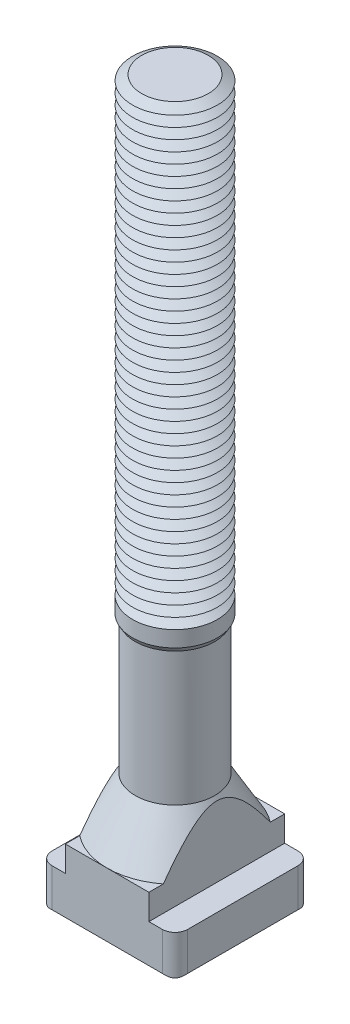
ISO-10303-21;
HEADER;
FILE_DESCRIPTION(('STEP AP214'),'2;1');
FILE_NAME('part.step','',(''),(''),'','','');
FILE_SCHEMA(('AUTOMOTIVE_DESIGN { 1 0 10303 214 1 1 1 1 }'));
ENDSEC;
DATA;
#1=APPLICATION_CONTEXT('core data for automotive mechanical design processes');
#2=APPLICATION_PROTOCOL_DEFINITION('international standard','automotive_design',2000,#1);
#3=PRODUCT_CONTEXT('',#1,'mechanical');
#4=PRODUCT('Part','Part','',(#3));
#5=PRODUCT_RELATED_PRODUCT_CATEGORY('part','',(#4));
#6=PRODUCT_DEFINITION_FORMATION('','',#4);
#7=PRODUCT_DEFINITION_CONTEXT('part definition',#1,'design');
#8=PRODUCT_DEFINITION('design','',#6,#7);
#9=PRODUCT_DEFINITION_SHAPE('','',#8);
#10=(LENGTH_UNIT() NAMED_UNIT(*) SI_UNIT(.MILLI.,.METRE.));
#11=(NAMED_UNIT(*) PLANE_ANGLE_UNIT() SI_UNIT($,.RADIAN.));
#12=(NAMED_UNIT(*) SI_UNIT($,.STERADIAN.) SOLID_ANGLE_UNIT());
#13=UNCERTAINTY_MEASURE_WITH_UNIT(LENGTH_MEASURE(1.E-05),#10,'distance_accuracy_value','');
#14=(GEOMETRIC_REPRESENTATION_CONTEXT(3) GLOBAL_UNCERTAINTY_ASSIGNED_CONTEXT((#13)) GLOBAL_UNIT_ASSIGNED_CONTEXT((#10,
#11,#12)) REPRESENTATION_CONTEXT('',''));
#15=CARTESIAN_POINT('',(0.,0.,0.));
#16=DIRECTION('',(0.,0.,1.));
#17=DIRECTION('',(1.,0.,0.));
#18=AXIS2_PLACEMENT_3D('',#15,#16,#17);
#19=CARTESIAN_POINT('',(0.,162.,0.));
#20=DIRECTION('',(0.,-1.,0.));
#21=DIRECTION('',(0.,0.,-1.));
#22=AXIS2_PLACEMENT_3D('',#19,#20,#21);
#23=CONICAL_SURFACE('',#22,7.83493649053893,1.0471975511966);
#24=CARTESIAN_POINT('',(0.,160.75,0.));
#25=DIRECTION('',(0.,-1.,0.));
#26=DIRECTION('',(0.,0.,-1.));
#27=AXIS2_PLACEMENT_3D('',#24,#25,#26);
#28=CIRCLE('',#27,10.);
#29=CARTESIAN_POINT('',(0.,160.75,-10.));
#30=VERTEX_POINT('',#29);
#31=EDGE_CURVE('E695',#30,#30,#28,.T.);
#32=ORIENTED_EDGE('',*,*,#31,.F.);
#33=EDGE_LOOP('',(#32));
#34=FACE_BOUND('',#33,.T.);
#35=CARTESIAN_POINT('',(0.,162.,0.));
#36=DIRECTION('',(0.,-1.,0.));
#37=DIRECTION('',(0.,0.,-1.));
#38=AXIS2_PLACEMENT_3D('',#35,#36,#37);
#39=CIRCLE('',#38,7.83493649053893);
#40=CARTESIAN_POINT('',(0.,162.,-7.83493649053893));
#41=VERTEX_POINT('',#40);
#42=EDGE_CURVE('E692',#41,#41,#39,.T.);
#43=ORIENTED_EDGE('',*,*,#42,.T.);
#44=EDGE_LOOP('',(#43));
#45=FACE_BOUND('',#44,.T.);
#46=ADVANCED_FACE('F39',(#34,#45),#23,.T.);
#47=CARTESIAN_POINT('',(0.,163.25,0.));
#48=DIRECTION('',(0.,1.,0.));
#49=DIRECTION('',(0.,0.,1.));
#50=AXIS2_PLACEMENT_3D('',#47,#48,#49);
#51=CONICAL_SURFACE('',#50,10.,1.0471975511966);
#52=ORIENTED_EDGE('',*,*,#42,.F.);
#53=EDGE_LOOP('',(#52));
#54=FACE_BOUND('',#53,.T.);
#55=CARTESIAN_POINT('',(0.,163.25,0.));
#56=DIRECTION('',(0.,-1.,0.));
#57=DIRECTION('',(0.,0.,-1.));
#58=AXIS2_PLACEMENT_3D('',#55,#56,#57);
#59=CIRCLE('',#58,10.);
#60=CARTESIAN_POINT('',(0.,163.25,-10.));
#61=VERTEX_POINT('',#60);
#62=EDGE_CURVE('E694',#61,#61,#59,.T.);
#63=ORIENTED_EDGE('',*,*,#62,.T.);
#64=EDGE_LOOP('',(#63));
#65=FACE_BOUND('',#64,.T.);
#66=ADVANCED_FACE('F448',(#54,#65),#51,.T.);
#67=CARTESIAN_POINT('',(4.73404929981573,172.,0.));
#68=DIRECTION('',(0.,-1.,0.));
#69=DIRECTION('',(1.,0.,0.));
#70=AXIS2_PLACEMENT_3D('',#67,#68,#69);
#71=PLANE('',#70);
#72=CARTESIAN_POINT('',(0.,172.,0.));
#73=DIRECTION('',(0.,-1.,0.));
#74=DIRECTION('',(0.,0.,-1.));
#75=AXIS2_PLACEMENT_3D('',#72,#73,#74);
#76=CIRCLE('',#75,7.83493649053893);
#77=CARTESIAN_POINT('',(0.,172.,-7.83493649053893));
#78=VERTEX_POINT('',#77);
#79=EDGE_CURVE('E792',#78,#78,#76,.T.);
#80=ORIENTED_EDGE('',*,*,#79,.F.);
#81=EDGE_LOOP('',(#80));
#82=FACE_BOUND('',#81,.T.);
#83=ADVANCED_FACE('F454',(#82),#71,.F.);
#84=CARTESIAN_POINT('',(0.,172.,0.));
#85=DIRECTION('',(0.,-1.,0.));
#86=DIRECTION('',(0.,0.,-1.));
#87=AXIS2_PLACEMENT_3D('',#84,#85,#86);
#88=CONICAL_SURFACE('',#87,7.83493649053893,1.0471975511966);
#89=CARTESIAN_POINT('',(0.,170.75,0.));
#90=DIRECTION('',(0.,-1.,0.));
#91=DIRECTION('',(0.,0.,-1.));
#92=AXIS2_PLACEMENT_3D('',#89,#90,#91);
#93=CIRCLE('',#92,10.);
#94=CARTESIAN_POINT('',(0.,170.75,-10.));
#95=VERTEX_POINT('',#94);
#96=EDGE_CURVE('E788',#95,#95,#93,.T.);
#97=ORIENTED_EDGE('',*,*,#96,.F.);
#98=EDGE_LOOP('',(#97));
#99=FACE_BOUND('',#98,.T.);
#100=ORIENTED_EDGE('',*,*,#79,.T.);
#101=EDGE_LOOP('',(#100));
#102=FACE_BOUND('',#101,.T.);
#103=ADVANCED_FACE('F482',(#99,#102),#88,.T.);
#104=CARTESIAN_POINT('',(0.,170.75,0.));
#105=DIRECTION('',(0.,1.,0.));
#106=DIRECTION('',(0.,0.,1.));
#107=AXIS2_PLACEMENT_3D('',#104,#105,#106);
#108=CONICAL_SURFACE('',#107,10.,1.0471975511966);
#109=CARTESIAN_POINT('',(0.,169.5,0.));
#110=DIRECTION('',(0.,-1.,0.));
#111=DIRECTION('',(0.,0.,-1.));
#112=AXIS2_PLACEMENT_3D('',#109,#110,#111);
#113=CIRCLE('',#112,7.83493649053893);
#114=CARTESIAN_POINT('',(0.,169.5,-7.83493649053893));
#115=VERTEX_POINT('',#114);
#116=EDGE_CURVE('E784',#115,#115,#113,.T.);
#117=ORIENTED_EDGE('',*,*,#116,.F.);
#118=EDGE_LOOP('',(#117));
#119=FACE_BOUND('',#118,.T.);
#120=ORIENTED_EDGE('',*,*,#96,.T.);
#121=EDGE_LOOP('',(#120));
#122=FACE_BOUND('',#121,.T.);
#123=ADVANCED_FACE('F479',(#119,#122),#108,.T.);
#124=CARTESIAN_POINT('',(0.,169.5,0.));
#125=DIRECTION('',(0.,-1.,0.));
#126=DIRECTION('',(0.,0.,-1.));
#127=AXIS2_PLACEMENT_3D('',#124,#125,#126);
#128=CONICAL_SURFACE('',#127,7.83493649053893,1.0471975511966);
#129=CARTESIAN_POINT('',(0.,168.25,0.));
#130=DIRECTION('',(0.,-1.,0.));
#131=DIRECTION('',(0.,0.,-1.));
#132=AXIS2_PLACEMENT_3D('',#129,#130,#131);
#133=CIRCLE('',#132,10.);
#134=CARTESIAN_POINT('',(0.,168.25,-10.));
#135=VERTEX_POINT('',#134);
#136=EDGE_CURVE('E664',#135,#135,#133,.T.);
#137=ORIENTED_EDGE('',*,*,#136,.F.);
#138=EDGE_LOOP('',(#137));
#139=FACE_BOUND('',#138,.T.);
#140=ORIENTED_EDGE('',*,*,#116,.T.);
#141=EDGE_LOOP('',(#140));
#142=FACE_BOUND('',#141,.T.);
#143=ADVANCED_FACE('F474',(#139,#142),#128,.T.);
#144=CARTESIAN_POINT('',(0.,168.25,0.));
#145=DIRECTION('',(0.,1.,0.));
#146=DIRECTION('',(0.,0.,1.));
#147=AXIS2_PLACEMENT_3D('',#144,#145,#146);
#148=CONICAL_SURFACE('',#147,10.,1.0471975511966);
#149=CARTESIAN_POINT('',(0.,167.,0.));
#150=DIRECTION('',(0.,-1.,0.));
#151=DIRECTION('',(0.,0.,-1.));
#152=AXIS2_PLACEMENT_3D('',#149,#150,#151);
#153=CIRCLE('',#152,7.83493649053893);
#154=CARTESIAN_POINT('',(0.,167.,-7.83493649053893));
#155=VERTEX_POINT('',#154);
#156=EDGE_CURVE('E662',#155,#155,#153,.T.);
#157=ORIENTED_EDGE('',*,*,#156,.F.);
#158=EDGE_LOOP('',(#157));
#159=FACE_BOUND('',#158,.T.);
#160=ORIENTED_EDGE('',*,*,#136,.T.);
#161=EDGE_LOOP('',(#160));
#162=FACE_BOUND('',#161,.T.);
#163=ADVANCED_FACE('F471',(#159,#162),#148,.T.);
#164=CARTESIAN_POINT('',(0.,167.,0.));
#165=DIRECTION('',(0.,-1.,0.));
#166=DIRECTION('',(0.,0.,-1.));
#167=AXIS2_PLACEMENT_3D('',#164,#165,#166);
#168=CONICAL_SURFACE('',#167,7.83493649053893,1.0471975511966);
#169=CARTESIAN_POINT('',(0.,165.75,0.));
#170=DIRECTION('',(0.,-1.,0.));
#171=DIRECTION('',(0.,0.,-1.));
#172=AXIS2_PLACEMENT_3D('',#169,#170,#171);
#173=CIRCLE('',#172,10.);
#174=CARTESIAN_POINT('',(0.,165.75,-10.));
#175=VERTEX_POINT('',#174);
#176=EDGE_CURVE('E665',#175,#175,#173,.T.);
#177=ORIENTED_EDGE('',*,*,#176,.F.);
#178=EDGE_LOOP('',(#177));
#179=FACE_BOUND('',#178,.T.);
#180=ORIENTED_EDGE('',*,*,#156,.T.);
#181=EDGE_LOOP('',(#180));
#182=FACE_BOUND('',#181,.T.);
#183=ADVANCED_FACE('F465',(#179,#182),#168,.T.);
#184=CARTESIAN_POINT('',(0.,165.75,0.));
#185=DIRECTION('',(0.,1.,0.));
#186=DIRECTION('',(0.,0.,1.));
#187=AXIS2_PLACEMENT_3D('',#184,#185,#186);
#188=CONICAL_SURFACE('',#187,10.,1.0471975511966);
#189=CARTESIAN_POINT('',(0.,164.5,0.));
#190=DIRECTION('',(0.,-1.,0.));
#191=DIRECTION('',(0.,0.,-1.));
#192=AXIS2_PLACEMENT_3D('',#189,#190,#191);
#193=CIRCLE('',#192,7.83493649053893);
#194=CARTESIAN_POINT('',(0.,164.5,-7.83493649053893));
#195=VERTEX_POINT('',#194);
#196=EDGE_CURVE('E774',#195,#195,#193,.T.);
#197=ORIENTED_EDGE('',*,*,#196,.F.);
#198=EDGE_LOOP('',(#197));
#199=FACE_BOUND('',#198,.T.);
#200=ORIENTED_EDGE('',*,*,#176,.T.);
#201=EDGE_LOOP('',(#200));
#202=FACE_BOUND('',#201,.T.);
#203=ADVANCED_FACE('F461',(#199,#202),#188,.T.);
#204=CARTESIAN_POINT('',(0.,164.5,0.));
#205=DIRECTION('',(0.,-1.,0.));
#206=DIRECTION('',(0.,0.,-1.));
#207=AXIS2_PLACEMENT_3D('',#204,#205,#206);
#208=CONICAL_SURFACE('',#207,7.83493649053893,1.0471975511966);
#209=ORIENTED_EDGE('',*,*,#62,.F.);
#210=EDGE_LOOP('',(#209));
#211=FACE_BOUND('',#210,.T.);
#212=ORIENTED_EDGE('',*,*,#196,.T.);
#213=EDGE_LOOP('',(#212));
#214=FACE_BOUND('',#213,.T.);
#215=ADVANCED_FACE('F464',(#211,#214),#208,.T.);
#216=CARTESIAN_POINT('',(0.,159.5,0.));
#217=DIRECTION('',(0.,-1.,0.));
#218=DIRECTION('',(0.,0.,-1.));
#219=AXIS2_PLACEMENT_3D('',#216,#217,#218);
#220=CONICAL_SURFACE('',#219,7.83493649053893,1.0471975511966);
#221=CARTESIAN_POINT('',(0.,158.25,0.));
#222=DIRECTION('',(0.,-1.,0.));
#223=DIRECTION('',(0.,0.,-1.));
#224=AXIS2_PLACEMENT_3D('',#221,#222,#223);
#225=CIRCLE('',#224,10.);
#226=CARTESIAN_POINT('',(0.,158.25,-10.));
#227=VERTEX_POINT('',#226);
#228=EDGE_CURVE('E686',#227,#227,#225,.T.);
#229=ORIENTED_EDGE('',*,*,#228,.F.);
#230=EDGE_LOOP('',(#229));
#231=FACE_BOUND('',#230,.T.);
#232=CARTESIAN_POINT('',(0.,159.5,0.));
#233=DIRECTION('',(0.,-1.,0.));
#234=DIRECTION('',(0.,0.,-1.));
#235=AXIS2_PLACEMENT_3D('',#232,#233,#234);
#236=CIRCLE('',#235,7.83493649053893);
#237=CARTESIAN_POINT('',(0.,159.5,-7.83493649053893));
#238=VERTEX_POINT('',#237);
#239=EDGE_CURVE('E689',#238,#238,#236,.T.);
#240=ORIENTED_EDGE('',*,*,#239,.T.);
#241=EDGE_LOOP('',(#240));
#242=FACE_BOUND('',#241,.T.);
#243=ADVANCED_FACE('F469',(#231,#242),#220,.T.);
#244=CARTESIAN_POINT('',(0.,160.75,0.));
#245=DIRECTION('',(0.,1.,0.));
#246=DIRECTION('',(0.,0.,1.));
#247=AXIS2_PLACEMENT_3D('',#244,#245,#246);
#248=CONICAL_SURFACE('',#247,10.,1.0471975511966);
#249=ORIENTED_EDGE('',*,*,#239,.F.);
#250=EDGE_LOOP('',(#249));
#251=FACE_BOUND('',#250,.T.);
#252=ORIENTED_EDGE('',*,*,#31,.T.);
#253=EDGE_LOOP('',(#252));
#254=FACE_BOUND('',#253,.T.);
#255=ADVANCED_FACE('F985',(#251,#254),#248,.T.);
#256=CARTESIAN_POINT('',(0.,157.,0.));
#257=DIRECTION('',(0.,-1.,0.));
#258=DIRECTION('',(0.,0.,-1.));
#259=AXIS2_PLACEMENT_3D('',#256,#257,#258);
#260=CONICAL_SURFACE('',#259,7.83493649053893,1.0471975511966);
#261=CARTESIAN_POINT('',(0.,155.75,0.));
#262=DIRECTION('',(0.,-1.,0.));
#263=DIRECTION('',(0.,0.,-1.));
#264=AXIS2_PLACEMENT_3D('',#261,#262,#263);
#265=CIRCLE('',#264,10.);
#266=CARTESIAN_POINT('',(0.,155.75,-10.));
#267=VERTEX_POINT('',#266);
#268=EDGE_CURVE('E759',#267,#267,#265,.T.);
#269=ORIENTED_EDGE('',*,*,#268,.F.);
#270=EDGE_LOOP('',(#269));
#271=FACE_BOUND('',#270,.T.);
#272=CARTESIAN_POINT('',(0.,157.,0.));
#273=DIRECTION('',(0.,-1.,0.));
#274=DIRECTION('',(0.,0.,-1.));
#275=AXIS2_PLACEMENT_3D('',#272,#273,#274);
#276=CIRCLE('',#275,7.83493649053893);
#277=CARTESIAN_POINT('',(0.,157.,-7.83493649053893));
#278=VERTEX_POINT('',#277);
#279=EDGE_CURVE('E690',#278,#278,#276,.T.);
#280=ORIENTED_EDGE('',*,*,#279,.T.);
#281=EDGE_LOOP('',(#280));
#282=FACE_BOUND('',#281,.T.);
#283=ADVANCED_FACE('F981',(#271,#282),#260,.T.);
#284=CARTESIAN_POINT('',(0.,158.25,0.));
#285=DIRECTION('',(0.,1.,0.));
#286=DIRECTION('',(0.,0.,1.));
#287=AXIS2_PLACEMENT_3D('',#284,#285,#286);
#288=CONICAL_SURFACE('',#287,10.,1.0471975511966);
#289=ORIENTED_EDGE('',*,*,#279,.F.);
#290=EDGE_LOOP('',(#289));
#291=FACE_BOUND('',#290,.T.);
#292=ORIENTED_EDGE('',*,*,#228,.T.);
#293=EDGE_LOOP('',(#292));
#294=FACE_BOUND('',#293,.T.);
#295=ADVANCED_FACE('F977',(#291,#294),#288,.T.);
#296=CARTESIAN_POINT('',(0.,154.5,0.));
#297=DIRECTION('',(0.,-1.,0.));
#298=DIRECTION('',(0.,0.,-1.));
#299=AXIS2_PLACEMENT_3D('',#296,#297,#298);
#300=CONICAL_SURFACE('',#299,7.83493649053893,1.0471975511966);
#301=CARTESIAN_POINT('',(0.,153.25,0.));
#302=DIRECTION('',(0.,-1.,0.));
#303=DIRECTION('',(0.,0.,-1.));
#304=AXIS2_PLACEMENT_3D('',#301,#302,#303);
#305=CIRCLE('',#304,10.);
#306=CARTESIAN_POINT('',(0.,153.25,-10.));
#307=VERTEX_POINT('',#306);
#308=EDGE_CURVE('E751',#307,#307,#305,.T.);
#309=ORIENTED_EDGE('',*,*,#308,.F.);
#310=EDGE_LOOP('',(#309));
#311=FACE_BOUND('',#310,.T.);
#312=CARTESIAN_POINT('',(0.,154.5,0.));
#313=DIRECTION('',(0.,-1.,0.));
#314=DIRECTION('',(0.,0.,-1.));
#315=AXIS2_PLACEMENT_3D('',#312,#313,#314);
#316=CIRCLE('',#315,7.83493649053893);
#317=CARTESIAN_POINT('',(0.,154.5,-7.83493649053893));
#318=VERTEX_POINT('',#317);
#319=EDGE_CURVE('E755',#318,#318,#316,.T.);
#320=ORIENTED_EDGE('',*,*,#319,.T.);
#321=EDGE_LOOP('',(#320));
#322=FACE_BOUND('',#321,.T.);
#323=ADVANCED_FACE('F973',(#311,#322),#300,.T.);
#324=CARTESIAN_POINT('',(0.,155.75,0.));
#325=DIRECTION('',(0.,1.,0.));
#326=DIRECTION('',(0.,0.,1.));
#327=AXIS2_PLACEMENT_3D('',#324,#325,#326);
#328=CONICAL_SURFACE('',#327,10.,1.0471975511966);
#329=ORIENTED_EDGE('',*,*,#319,.F.);
#330=EDGE_LOOP('',(#329));
#331=FACE_BOUND('',#330,.T.);
#332=ORIENTED_EDGE('',*,*,#268,.T.);
#333=EDGE_LOOP('',(#332));
#334=FACE_BOUND('',#333,.T.);
#335=ADVANCED_FACE('F969',(#331,#334),#328,.T.);
#336=CARTESIAN_POINT('',(0.,152.,0.));
#337=DIRECTION('',(0.,-1.,0.));
#338=DIRECTION('',(0.,0.,-1.));
#339=AXIS2_PLACEMENT_3D('',#336,#337,#338);
#340=CONICAL_SURFACE('',#339,7.83493649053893,1.0471975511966);
#341=CARTESIAN_POINT('',(0.,150.75,0.));
#342=DIRECTION('',(0.,-1.,0.));
#343=DIRECTION('',(0.,0.,-1.));
#344=AXIS2_PLACEMENT_3D('',#341,#342,#343);
#345=CIRCLE('',#344,10.);
#346=CARTESIAN_POINT('',(0.,150.75,-10.));
#347=VERTEX_POINT('',#346);
#348=EDGE_CURVE('E743',#347,#347,#345,.T.);
#349=ORIENTED_EDGE('',*,*,#348,.F.);
#350=EDGE_LOOP('',(#349));
#351=FACE_BOUND('',#350,.T.);
#352=CARTESIAN_POINT('',(0.,152.,0.));
#353=DIRECTION('',(0.,-1.,0.));
#354=DIRECTION('',(0.,0.,-1.));
#355=AXIS2_PLACEMENT_3D('',#352,#353,#354);
#356=CIRCLE('',#355,7.83493649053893);
#357=CARTESIAN_POINT('',(0.,152.,-7.83493649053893));
#358=VERTEX_POINT('',#357);
#359=EDGE_CURVE('E747',#358,#358,#356,.T.);
#360=ORIENTED_EDGE('',*,*,#359,.T.);
#361=EDGE_LOOP('',(#360));
#362=FACE_BOUND('',#361,.T.);
#363=ADVANCED_FACE('F965',(#351,#362),#340,.T.);
#364=CARTESIAN_POINT('',(0.,153.25,0.));
#365=DIRECTION('',(0.,1.,0.));
#366=DIRECTION('',(0.,0.,1.));
#367=AXIS2_PLACEMENT_3D('',#364,#365,#366);
#368=CONICAL_SURFACE('',#367,10.,1.0471975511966);
#369=ORIENTED_EDGE('',*,*,#359,.F.);
#370=EDGE_LOOP('',(#369));
#371=FACE_BOUND('',#370,.T.);
#372=ORIENTED_EDGE('',*,*,#308,.T.);
#373=EDGE_LOOP('',(#372));
#374=FACE_BOUND('',#373,.T.);
#375=ADVANCED_FACE('F961',(#371,#374),#368,.T.);
#376=CARTESIAN_POINT('',(0.,149.5,0.));
#377=DIRECTION('',(0.,-1.,0.));
#378=DIRECTION('',(0.,0.,-1.));
#379=AXIS2_PLACEMENT_3D('',#376,#377,#378);
#380=CONICAL_SURFACE('',#379,7.83493649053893,1.0471975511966);
#381=CARTESIAN_POINT('',(0.,148.25,0.));
#382=DIRECTION('',(0.,-1.,0.));
#383=DIRECTION('',(0.,0.,-1.));
#384=AXIS2_PLACEMENT_3D('',#381,#382,#383);
#385=CIRCLE('',#384,10.);
#386=CARTESIAN_POINT('',(0.,148.25,-10.));
#387=VERTEX_POINT('',#386);
#388=EDGE_CURVE('E725',#387,#387,#385,.T.);
#389=ORIENTED_EDGE('',*,*,#388,.F.);
#390=EDGE_LOOP('',(#389));
#391=FACE_BOUND('',#390,.T.);
#392=CARTESIAN_POINT('',(0.,149.5,0.));
#393=DIRECTION('',(0.,-1.,0.));
#394=DIRECTION('',(0.,0.,-1.));
#395=AXIS2_PLACEMENT_3D('',#392,#393,#394);
#396=CIRCLE('',#395,7.83493649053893);
#397=CARTESIAN_POINT('',(0.,149.5,-7.83493649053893));
#398=VERTEX_POINT('',#397);
#399=EDGE_CURVE('E732',#398,#398,#396,.T.);
#400=ORIENTED_EDGE('',*,*,#399,.T.);
#401=EDGE_LOOP('',(#400));
#402=FACE_BOUND('',#401,.T.);
#403=ADVANCED_FACE('F954',(#391,#402),#380,.T.);
#404=CARTESIAN_POINT('',(0.,150.75,0.));
#405=DIRECTION('',(0.,1.,0.));
#406=DIRECTION('',(0.,0.,1.));
#407=AXIS2_PLACEMENT_3D('',#404,#405,#406);
#408=CONICAL_SURFACE('',#407,10.,1.0471975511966);
#409=ORIENTED_EDGE('',*,*,#399,.F.);
#410=EDGE_LOOP('',(#409));
#411=FACE_BOUND('',#410,.T.);
#412=ORIENTED_EDGE('',*,*,#348,.T.);
#413=EDGE_LOOP('',(#412));
#414=FACE_BOUND('',#413,.T.);
#415=ADVANCED_FACE('F946',(#411,#414),#408,.T.);
#416=CARTESIAN_POINT('',(0.,147.,0.));
#417=DIRECTION('',(0.,-1.,0.));
#418=DIRECTION('',(0.,0.,-1.));
#419=AXIS2_PLACEMENT_3D('',#416,#417,#418);
#420=CONICAL_SURFACE('',#419,7.83493649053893,1.0471975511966);
#421=CARTESIAN_POINT('',(0.,145.75,0.));
#422=DIRECTION('',(0.,-1.,0.));
#423=DIRECTION('',(0.,0.,-1.));
#424=AXIS2_PLACEMENT_3D('',#421,#422,#423);
#425=CIRCLE('',#424,10.);
#426=CARTESIAN_POINT('',(0.,145.75,-10.));
#427=VERTEX_POINT('',#426);
#428=EDGE_CURVE('E726',#427,#427,#425,.T.);
#429=ORIENTED_EDGE('',*,*,#428,.F.);
#430=EDGE_LOOP('',(#429));
#431=FACE_BOUND('',#430,.T.);
#432=CARTESIAN_POINT('',(0.,147.,0.));
#433=DIRECTION('',(0.,-1.,0.));
#434=DIRECTION('',(0.,0.,-1.));
#435=AXIS2_PLACEMENT_3D('',#432,#433,#434);
#436=CIRCLE('',#435,7.83493649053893);
#437=CARTESIAN_POINT('',(0.,147.,-7.83493649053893));
#438=VERTEX_POINT('',#437);
#439=EDGE_CURVE('E723',#438,#438,#436,.T.);
#440=ORIENTED_EDGE('',*,*,#439,.T.);
#441=EDGE_LOOP('',(#440));
#442=FACE_BOUND('',#441,.T.);
#443=ADVANCED_FACE('F943',(#431,#442),#420,.T.);
#444=CARTESIAN_POINT('',(0.,148.25,0.));
#445=DIRECTION('',(0.,1.,0.));
#446=DIRECTION('',(0.,0.,1.));
#447=AXIS2_PLACEMENT_3D('',#444,#445,#446);
#448=CONICAL_SURFACE('',#447,10.,1.0471975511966);
#449=ORIENTED_EDGE('',*,*,#439,.F.);
#450=EDGE_LOOP('',(#449));
#451=FACE_BOUND('',#450,.T.);
#452=ORIENTED_EDGE('',*,*,#388,.T.);
#453=EDGE_LOOP('',(#452));
#454=FACE_BOUND('',#453,.T.);
#455=ADVANCED_FACE('F945',(#451,#454),#448,.T.);
#456=CARTESIAN_POINT('',(0.,144.5,0.));
#457=DIRECTION('',(0.,-1.,0.));
#458=DIRECTION('',(0.,0.,-1.));
#459=AXIS2_PLACEMENT_3D('',#456,#457,#458);
#460=CONICAL_SURFACE('',#459,7.83493649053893,1.0471975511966);
#461=CARTESIAN_POINT('',(0.,143.25,0.));
#462=DIRECTION('',(0.,-1.,0.));
#463=DIRECTION('',(0.,0.,-1.));
#464=AXIS2_PLACEMENT_3D('',#461,#462,#463);
#465=CIRCLE('',#464,10.);
#466=CARTESIAN_POINT('',(0.,143.25,-10.));
#467=VERTEX_POINT('',#466);
#468=EDGE_CURVE('E659',#467,#467,#465,.T.);
#469=ORIENTED_EDGE('',*,*,#468,.F.);
#470=EDGE_LOOP('',(#469));
#471=FACE_BOUND('',#470,.T.);
#472=CARTESIAN_POINT('',(0.,144.5,0.));
#473=DIRECTION('',(0.,-1.,0.));
#474=DIRECTION('',(0.,0.,-1.));
#475=AXIS2_PLACEMENT_3D('',#472,#473,#474);
#476=CIRCLE('',#475,7.83493649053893);
#477=CARTESIAN_POINT('',(0.,144.5,-7.83493649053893));
#478=VERTEX_POINT('',#477);
#479=EDGE_CURVE('E736',#478,#478,#476,.T.);
#480=ORIENTED_EDGE('',*,*,#479,.T.);
#481=EDGE_LOOP('',(#480));
#482=FACE_BOUND('',#481,.T.);
#483=ADVANCED_FACE('F934',(#471,#482),#460,.T.);
#484=CARTESIAN_POINT('',(0.,145.75,0.));
#485=DIRECTION('',(0.,1.,0.));
#486=DIRECTION('',(0.,0.,1.));
#487=AXIS2_PLACEMENT_3D('',#484,#485,#486);
#488=CONICAL_SURFACE('',#487,10.,1.0471975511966);
#489=ORIENTED_EDGE('',*,*,#479,.F.);
#490=EDGE_LOOP('',(#489));
#491=FACE_BOUND('',#490,.T.);
#492=ORIENTED_EDGE('',*,*,#428,.T.);
#493=EDGE_LOOP('',(#492));
#494=FACE_BOUND('',#493,.T.);
#495=ADVANCED_FACE('F936',(#491,#494),#488,.T.);
#496=CARTESIAN_POINT('',(0.,142.,0.));
#497=DIRECTION('',(0.,-1.,0.));
#498=DIRECTION('',(0.,0.,-1.));
#499=AXIS2_PLACEMENT_3D('',#496,#497,#498);
#500=CONICAL_SURFACE('',#499,7.83493649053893,1.0471975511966);
#501=CARTESIAN_POINT('',(0.,140.75,0.));
#502=DIRECTION('',(0.,-1.,0.));
#503=DIRECTION('',(0.,0.,-1.));
#504=AXIS2_PLACEMENT_3D('',#501,#502,#503);
#505=CIRCLE('',#504,10.);
#506=CARTESIAN_POINT('',(0.,140.75,-10.));
#507=VERTEX_POINT('',#506);
#508=EDGE_CURVE('E660',#507,#507,#505,.T.);
#509=ORIENTED_EDGE('',*,*,#508,.F.);
#510=EDGE_LOOP('',(#509));
#511=FACE_BOUND('',#510,.T.);
#512=CARTESIAN_POINT('',(0.,142.,0.));
#513=DIRECTION('',(0.,-1.,0.));
#514=DIRECTION('',(0.,0.,-1.));
#515=AXIS2_PLACEMENT_3D('',#512,#513,#514);
#516=CIRCLE('',#515,7.83493649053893);
#517=CARTESIAN_POINT('',(0.,142.,-7.83493649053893));
#518=VERTEX_POINT('',#517);
#519=EDGE_CURVE('E656',#518,#518,#516,.T.);
#520=ORIENTED_EDGE('',*,*,#519,.T.);
#521=EDGE_LOOP('',(#520));
#522=FACE_BOUND('',#521,.T.);
#523=ADVANCED_FACE('F939',(#511,#522),#500,.T.);
#524=CARTESIAN_POINT('',(0.,143.25,0.));
#525=DIRECTION('',(0.,1.,0.));
#526=DIRECTION('',(0.,0.,1.));
#527=AXIS2_PLACEMENT_3D('',#524,#525,#526);
#528=CONICAL_SURFACE('',#527,10.,1.0471975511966);
#529=ORIENTED_EDGE('',*,*,#519,.F.);
#530=EDGE_LOOP('',(#529));
#531=FACE_BOUND('',#530,.T.);
#532=ORIENTED_EDGE('',*,*,#468,.T.);
#533=EDGE_LOOP('',(#532));
#534=FACE_BOUND('',#533,.T.);
#535=ADVANCED_FACE('F1054',(#531,#534),#528,.T.);
#536=CARTESIAN_POINT('',(0.,139.5,0.));
#537=DIRECTION('',(0.,-1.,0.));
#538=DIRECTION('',(0.,0.,-1.));
#539=AXIS2_PLACEMENT_3D('',#536,#537,#538);
#540=CONICAL_SURFACE('',#539,7.83493649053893,1.0471975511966);
#541=CARTESIAN_POINT('',(0.,138.25,0.));
#542=DIRECTION('',(0.,-1.,0.));
#543=DIRECTION('',(0.,0.,-1.));
#544=AXIS2_PLACEMENT_3D('',#541,#542,#543);
#545=CIRCLE('',#544,10.);
#546=CARTESIAN_POINT('',(0.,138.25,-10.));
#547=VERTEX_POINT('',#546);
#548=EDGE_CURVE('E866',#547,#547,#545,.T.);
#549=ORIENTED_EDGE('',*,*,#548,.F.);
#550=EDGE_LOOP('',(#549));
#551=FACE_BOUND('',#550,.T.);
#552=CARTESIAN_POINT('',(0.,139.5,0.));
#553=DIRECTION('',(0.,-1.,0.));
#554=DIRECTION('',(0.,0.,-1.));
#555=AXIS2_PLACEMENT_3D('',#552,#553,#554);
#556=CIRCLE('',#555,7.83493649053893);
#557=CARTESIAN_POINT('',(0.,139.5,-7.83493649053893));
#558=VERTEX_POINT('',#557);
#559=EDGE_CURVE('E920',#558,#558,#556,.T.);
#560=ORIENTED_EDGE('',*,*,#559,.T.);
#561=EDGE_LOOP('',(#560));
#562=FACE_BOUND('',#561,.T.);
#563=ADVANCED_FACE('F1063',(#551,#562),#540,.T.);
#564=CARTESIAN_POINT('',(0.,140.75,0.));
#565=DIRECTION('',(0.,1.,0.));
#566=DIRECTION('',(0.,0.,1.));
#567=AXIS2_PLACEMENT_3D('',#564,#565,#566);
#568=CONICAL_SURFACE('',#567,10.,1.0471975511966);
#569=ORIENTED_EDGE('',*,*,#559,.F.);
#570=EDGE_LOOP('',(#569));
#571=FACE_BOUND('',#570,.T.);
#572=ORIENTED_EDGE('',*,*,#508,.T.);
#573=EDGE_LOOP('',(#572));
#574=FACE_BOUND('',#573,.T.);
#575=ADVANCED_FACE('F1072',(#571,#574),#568,.T.);
#576=CARTESIAN_POINT('',(0.,137.,0.));
#577=DIRECTION('',(0.,-1.,0.));
#578=DIRECTION('',(0.,0.,-1.));
#579=AXIS2_PLACEMENT_3D('',#576,#577,#578);
#580=CONICAL_SURFACE('',#579,7.83493649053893,1.0471975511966);
#581=CARTESIAN_POINT('',(0.,135.75,0.));
#582=DIRECTION('',(0.,-1.,0.));
#583=DIRECTION('',(0.,0.,-1.));
#584=AXIS2_PLACEMENT_3D('',#581,#582,#583);
#585=CIRCLE('',#584,10.);
#586=CARTESIAN_POINT('',(0.,135.75,-10.));
#587=VERTEX_POINT('',#586);
#588=EDGE_CURVE('E653',#587,#587,#585,.T.);
#589=ORIENTED_EDGE('',*,*,#588,.F.);
#590=EDGE_LOOP('',(#589));
#591=FACE_BOUND('',#590,.T.);
#592=CARTESIAN_POINT('',(0.,137.,0.));
#593=DIRECTION('',(0.,-1.,0.));
#594=DIRECTION('',(0.,0.,-1.));
#595=AXIS2_PLACEMENT_3D('',#592,#593,#594);
#596=CIRCLE('',#595,7.83493649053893);
#597=CARTESIAN_POINT('',(0.,137.,-7.83493649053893));
#598=VERTEX_POINT('',#597);
#599=EDGE_CURVE('E864',#598,#598,#596,.T.);
#600=ORIENTED_EDGE('',*,*,#599,.T.);
#601=EDGE_LOOP('',(#600));
#602=FACE_BOUND('',#601,.T.);
#603=ADVANCED_FACE('F1081',(#591,#602),#580,.T.);
#604=CARTESIAN_POINT('',(0.,138.25,0.));
#605=DIRECTION('',(0.,1.,0.));
#606=DIRECTION('',(0.,0.,1.));
#607=AXIS2_PLACEMENT_3D('',#604,#605,#606);
#608=CONICAL_SURFACE('',#607,10.,1.0471975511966);
#609=ORIENTED_EDGE('',*,*,#599,.F.);
#610=EDGE_LOOP('',(#609));
#611=FACE_BOUND('',#610,.T.);
#612=ORIENTED_EDGE('',*,*,#548,.T.);
#613=EDGE_LOOP('',(#612));
#614=FACE_BOUND('',#613,.T.);
#615=ADVANCED_FACE('F1090',(#611,#614),#608,.T.);
#616=CARTESIAN_POINT('',(0.,134.5,0.));
#617=DIRECTION('',(0.,-1.,0.));
#618=DIRECTION('',(0.,0.,-1.));
#619=AXIS2_PLACEMENT_3D('',#616,#617,#618);
#620=CONICAL_SURFACE('',#619,7.83493649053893,1.0471975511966);
#621=CARTESIAN_POINT('',(0.,133.25,0.));
#622=DIRECTION('',(0.,-1.,0.));
#623=DIRECTION('',(0.,0.,-1.));
#624=AXIS2_PLACEMENT_3D('',#621,#622,#623);
#625=CIRCLE('',#624,10.);
#626=CARTESIAN_POINT('',(0.,133.25,-10.));
#627=VERTEX_POINT('',#626);
#628=EDGE_CURVE('E654',#627,#627,#625,.T.);
#629=ORIENTED_EDGE('',*,*,#628,.F.);
#630=EDGE_LOOP('',(#629));
#631=FACE_BOUND('',#630,.T.);
#632=CARTESIAN_POINT('',(0.,134.5,0.));
#633=DIRECTION('',(0.,-1.,0.));
#634=DIRECTION('',(0.,0.,-1.));
#635=AXIS2_PLACEMENT_3D('',#632,#633,#634);
#636=CIRCLE('',#635,7.83493649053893);
#637=CARTESIAN_POINT('',(0.,134.5,-7.83493649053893));
#638=VERTEX_POINT('',#637);
#639=EDGE_CURVE('E650',#638,#638,#636,.T.);
#640=ORIENTED_EDGE('',*,*,#639,.T.);
#641=EDGE_LOOP('',(#640));
#642=FACE_BOUND('',#641,.T.);
#643=ADVANCED_FACE('F1099',(#631,#642),#620,.T.);
#644=CARTESIAN_POINT('',(0.,135.75,0.));
#645=DIRECTION('',(0.,1.,0.));
#646=DIRECTION('',(0.,0.,1.));
#647=AXIS2_PLACEMENT_3D('',#644,#645,#646);
#648=CONICAL_SURFACE('',#647,10.,1.0471975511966);
#649=ORIENTED_EDGE('',*,*,#639,.F.);
#650=EDGE_LOOP('',(#649));
#651=FACE_BOUND('',#650,.T.);
#652=ORIENTED_EDGE('',*,*,#588,.T.);
#653=EDGE_LOOP('',(#652));
#654=FACE_BOUND('',#653,.T.);
#655=ADVANCED_FACE('F1108',(#651,#654),#648,.T.);
#656=CARTESIAN_POINT('',(0.,132.,0.));
#657=DIRECTION('',(0.,-1.,0.));
#658=DIRECTION('',(0.,0.,-1.));
#659=AXIS2_PLACEMENT_3D('',#656,#657,#658);
#660=CONICAL_SURFACE('',#659,7.83493649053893,1.0471975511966);
#661=CARTESIAN_POINT('',(0.,130.75,0.));
#662=DIRECTION('',(0.,-1.,0.));
#663=DIRECTION('',(0.,0.,-1.));
#664=AXIS2_PLACEMENT_3D('',#661,#662,#663);
#665=CIRCLE('',#664,10.);
#666=CARTESIAN_POINT('',(0.,130.75,-10.));
#667=VERTEX_POINT('',#666);
#668=EDGE_CURVE('E903',#667,#667,#665,.T.);
#669=ORIENTED_EDGE('',*,*,#668,.F.);
#670=EDGE_LOOP('',(#669));
#671=FACE_BOUND('',#670,.T.);
#672=CARTESIAN_POINT('',(0.,132.,0.));
#673=DIRECTION('',(0.,-1.,0.));
#674=DIRECTION('',(0.,0.,-1.));
#675=AXIS2_PLACEMENT_3D('',#672,#673,#674);
#676=CIRCLE('',#675,7.83493649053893);
#677=CARTESIAN_POINT('',(0.,132.,-7.83493649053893));
#678=VERTEX_POINT('',#677);
#679=EDGE_CURVE('E907',#678,#678,#676,.T.);
#680=ORIENTED_EDGE('',*,*,#679,.T.);
#681=EDGE_LOOP('',(#680));
#682=FACE_BOUND('',#681,.T.);
#683=ADVANCED_FACE('F1117',(#671,#682),#660,.T.);
#684=CARTESIAN_POINT('',(0.,133.25,0.));
#685=DIRECTION('',(0.,1.,0.));
#686=DIRECTION('',(0.,0.,1.));
#687=AXIS2_PLACEMENT_3D('',#684,#685,#686);
#688=CONICAL_SURFACE('',#687,10.,1.0471975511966);
#689=ORIENTED_EDGE('',*,*,#679,.F.);
#690=EDGE_LOOP('',(#689));
#691=FACE_BOUND('',#690,.T.);
#692=ORIENTED_EDGE('',*,*,#628,.T.);
#693=EDGE_LOOP('',(#692));
#694=FACE_BOUND('',#693,.T.);
#695=ADVANCED_FACE('F1126',(#691,#694),#688,.T.);
#696=CARTESIAN_POINT('',(0.,129.5,0.));
#697=DIRECTION('',(0.,-1.,0.));
#698=DIRECTION('',(0.,0.,-1.));
#699=AXIS2_PLACEMENT_3D('',#696,#697,#698);
#700=CONICAL_SURFACE('',#699,7.83493649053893,1.0471975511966);
#701=CARTESIAN_POINT('',(0.,128.25,0.));
#702=DIRECTION('',(0.,-1.,0.));
#703=DIRECTION('',(0.,0.,-1.));
#704=AXIS2_PLACEMENT_3D('',#701,#702,#703);
#705=CIRCLE('',#704,10.);
#706=CARTESIAN_POINT('',(0.,128.25,-10.));
#707=VERTEX_POINT('',#706);
#708=EDGE_CURVE('E680',#707,#707,#705,.T.);
#709=ORIENTED_EDGE('',*,*,#708,.F.);
#710=EDGE_LOOP('',(#709));
#711=FACE_BOUND('',#710,.T.);
#712=CARTESIAN_POINT('',(0.,129.5,0.));
#713=DIRECTION('',(0.,-1.,0.));
#714=DIRECTION('',(0.,0.,-1.));
#715=AXIS2_PLACEMENT_3D('',#712,#713,#714);
#716=CIRCLE('',#715,7.83493649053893);
#717=CARTESIAN_POINT('',(0.,129.5,-7.83493649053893));
#718=VERTEX_POINT('',#717);
#719=EDGE_CURVE('E683',#718,#718,#716,.T.);
#720=ORIENTED_EDGE('',*,*,#719,.T.);
#721=EDGE_LOOP('',(#720));
#722=FACE_BOUND('',#721,.T.);
#723=ADVANCED_FACE('F1135',(#711,#722),#700,.T.);
#724=CARTESIAN_POINT('',(0.,130.75,0.));
#725=DIRECTION('',(0.,1.,0.));
#726=DIRECTION('',(0.,0.,1.));
#727=AXIS2_PLACEMENT_3D('',#724,#725,#726);
#728=CONICAL_SURFACE('',#727,10.,1.0471975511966);
#729=ORIENTED_EDGE('',*,*,#719,.F.);
#730=EDGE_LOOP('',(#729));
#731=FACE_BOUND('',#730,.T.);
#732=ORIENTED_EDGE('',*,*,#668,.T.);
#733=EDGE_LOOP('',(#732));
#734=FACE_BOUND('',#733,.T.);
#735=ADVANCED_FACE('F1144',(#731,#734),#728,.T.);
#736=CARTESIAN_POINT('',(0.,127.,0.));
#737=DIRECTION('',(0.,-1.,0.));
#738=DIRECTION('',(0.,0.,-1.));
#739=AXIS2_PLACEMENT_3D('',#736,#737,#738);
#740=CONICAL_SURFACE('',#739,7.83493649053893,1.0471975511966);
#741=CARTESIAN_POINT('',(0.,125.75,0.));
#742=DIRECTION('',(0.,-1.,0.));
#743=DIRECTION('',(0.,0.,-1.));
#744=AXIS2_PLACEMENT_3D('',#741,#742,#743);
#745=CIRCLE('',#744,10.);
#746=CARTESIAN_POINT('',(0.,125.75,-10.));
#747=VERTEX_POINT('',#746);
#748=EDGE_CURVE('E880',#747,#747,#745,.T.);
#749=ORIENTED_EDGE('',*,*,#748,.F.);
#750=EDGE_LOOP('',(#749));
#751=FACE_BOUND('',#750,.T.);
#752=CARTESIAN_POINT('',(0.,127.,0.));
#753=DIRECTION('',(0.,-1.,0.));
#754=DIRECTION('',(0.,0.,-1.));
#755=AXIS2_PLACEMENT_3D('',#752,#753,#754);
#756=CIRCLE('',#755,7.83493649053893);
#757=CARTESIAN_POINT('',(0.,127.,-7.83493649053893));
#758=VERTEX_POINT('',#757);
#759=EDGE_CURVE('E684',#758,#758,#756,.T.);
#760=ORIENTED_EDGE('',*,*,#759,.T.);
#761=EDGE_LOOP('',(#760));
#762=FACE_BOUND('',#761,.T.);
#763=ADVANCED_FACE('F1153',(#751,#762),#740,.T.);
#764=CARTESIAN_POINT('',(0.,128.25,0.));
#765=DIRECTION('',(0.,1.,0.));
#766=DIRECTION('',(0.,0.,1.));
#767=AXIS2_PLACEMENT_3D('',#764,#765,#766);
#768=CONICAL_SURFACE('',#767,10.,1.0471975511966);
#769=ORIENTED_EDGE('',*,*,#759,.F.);
#770=EDGE_LOOP('',(#769));
#771=FACE_BOUND('',#770,.T.);
#772=ORIENTED_EDGE('',*,*,#708,.T.);
#773=EDGE_LOOP('',(#772));
#774=FACE_BOUND('',#773,.T.);
#775=ADVANCED_FACE('F1162',(#771,#774),#768,.T.);
#776=CARTESIAN_POINT('',(0.,124.5,0.));
#777=DIRECTION('',(0.,-1.,0.));
#778=DIRECTION('',(0.,0.,-1.));
#779=AXIS2_PLACEMENT_3D('',#776,#777,#778);
#780=CONICAL_SURFACE('',#779,7.83493649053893,1.0471975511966);
#781=CARTESIAN_POINT('',(0.,123.25,0.));
#782=DIRECTION('',(0.,-1.,0.));
#783=DIRECTION('',(0.,0.,-1.));
#784=AXIS2_PLACEMENT_3D('',#781,#782,#783);
#785=CIRCLE('',#784,10.);
#786=CARTESIAN_POINT('',(0.,123.25,-10.));
#787=VERTEX_POINT('',#786);
#788=EDGE_CURVE('E881',#787,#787,#785,.T.);
#789=ORIENTED_EDGE('',*,*,#788,.F.);
#790=EDGE_LOOP('',(#789));
#791=FACE_BOUND('',#790,.T.);
#792=CARTESIAN_POINT('',(0.,124.5,0.));
#793=DIRECTION('',(0.,-1.,0.));
#794=DIRECTION('',(0.,0.,-1.));
#795=AXIS2_PLACEMENT_3D('',#792,#793,#794);
#796=CIRCLE('',#795,7.83493649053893);
#797=CARTESIAN_POINT('',(0.,124.5,-7.83493649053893));
#798=VERTEX_POINT('',#797);
#799=EDGE_CURVE('E877',#798,#798,#796,.T.);
#800=ORIENTED_EDGE('',*,*,#799,.T.);
#801=EDGE_LOOP('',(#800));
#802=FACE_BOUND('',#801,.T.);
#803=ADVANCED_FACE('F1171',(#791,#802),#780,.T.);
#804=CARTESIAN_POINT('',(0.,125.75,0.));
#805=DIRECTION('',(0.,1.,0.));
#806=DIRECTION('',(0.,0.,1.));
#807=AXIS2_PLACEMENT_3D('',#804,#805,#806);
#808=CONICAL_SURFACE('',#807,10.,1.0471975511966);
#809=ORIENTED_EDGE('',*,*,#799,.F.);
#810=EDGE_LOOP('',(#809));
#811=FACE_BOUND('',#810,.T.);
#812=ORIENTED_EDGE('',*,*,#748,.T.);
#813=EDGE_LOOP('',(#812));
#814=FACE_BOUND('',#813,.T.);
#815=ADVANCED_FACE('F1180',(#811,#814),#808,.T.);
#816=CARTESIAN_POINT('',(0.,122.,0.));
#817=DIRECTION('',(0.,-1.,0.));
#818=DIRECTION('',(0.,0.,-1.));
#819=AXIS2_PLACEMENT_3D('',#816,#817,#818);
#820=CONICAL_SURFACE('',#819,7.83493649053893,1.0471975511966);
#821=CARTESIAN_POINT('',(0.,120.75,0.));
#822=DIRECTION('',(0.,-1.,0.));
#823=DIRECTION('',(0.,0.,-1.));
#824=AXIS2_PLACEMENT_3D('',#821,#822,#823);
#825=CIRCLE('',#824,10.);
#826=CARTESIAN_POINT('',(0.,120.75,-10.));
#827=VERTEX_POINT('',#826);
#828=EDGE_CURVE('E890',#827,#827,#825,.T.);
#829=ORIENTED_EDGE('',*,*,#828,.F.);
#830=EDGE_LOOP('',(#829));
#831=FACE_BOUND('',#830,.T.);
#832=CARTESIAN_POINT('',(0.,122.,0.));
#833=DIRECTION('',(0.,-1.,0.));
#834=DIRECTION('',(0.,0.,-1.));
#835=AXIS2_PLACEMENT_3D('',#832,#833,#834);
#836=CIRCLE('',#835,7.83493649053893);
#837=CARTESIAN_POINT('',(0.,122.,-7.83493649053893));
#838=VERTEX_POINT('',#837);
#839=EDGE_CURVE('E884',#838,#838,#836,.T.);
#840=ORIENTED_EDGE('',*,*,#839,.T.);
#841=EDGE_LOOP('',(#840));
#842=FACE_BOUND('',#841,.T.);
#843=ADVANCED_FACE('F1189',(#831,#842),#820,.T.);
#844=CARTESIAN_POINT('',(0.,123.25,0.));
#845=DIRECTION('',(0.,1.,0.));
#846=DIRECTION('',(0.,0.,1.));
#847=AXIS2_PLACEMENT_3D('',#844,#845,#846);
#848=CONICAL_SURFACE('',#847,10.,1.0471975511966);
#849=ORIENTED_EDGE('',*,*,#839,.F.);
#850=EDGE_LOOP('',(#849));
#851=FACE_BOUND('',#850,.T.);
#852=ORIENTED_EDGE('',*,*,#788,.T.);
#853=EDGE_LOOP('',(#852));
#854=FACE_BOUND('',#853,.T.);
#855=ADVANCED_FACE('F1198',(#851,#854),#848,.T.);
#856=CARTESIAN_POINT('',(0.,119.5,0.));
#857=DIRECTION('',(0.,-1.,0.));
#858=DIRECTION('',(0.,0.,-1.));
#859=AXIS2_PLACEMENT_3D('',#856,#857,#858);
#860=CONICAL_SURFACE('',#859,7.83493649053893,1.0471975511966);
#861=CARTESIAN_POINT('',(0.,118.25,0.));
#862=DIRECTION('',(0.,-1.,0.));
#863=DIRECTION('',(0.,0.,-1.));
#864=AXIS2_PLACEMENT_3D('',#861,#862,#863);
#865=CIRCLE('',#864,10.);
#866=CARTESIAN_POINT('',(0.,118.25,-10.));
#867=VERTEX_POINT('',#866);
#868=EDGE_CURVE('E844',#867,#867,#865,.T.);
#869=ORIENTED_EDGE('',*,*,#868,.F.);
#870=EDGE_LOOP('',(#869));
#871=FACE_BOUND('',#870,.T.);
#872=CARTESIAN_POINT('',(0.,119.5,0.));
#873=DIRECTION('',(0.,-1.,0.));
#874=DIRECTION('',(0.,0.,-1.));
#875=AXIS2_PLACEMENT_3D('',#872,#873,#874);
#876=CIRCLE('',#875,7.83493649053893);
#877=CARTESIAN_POINT('',(0.,119.5,-7.83493649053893));
#878=VERTEX_POINT('',#877);
#879=EDGE_CURVE('E846',#878,#878,#876,.T.);
#880=ORIENTED_EDGE('',*,*,#879,.T.);
#881=EDGE_LOOP('',(#880));
#882=FACE_BOUND('',#881,.T.);
#883=ADVANCED_FACE('F1207',(#871,#882),#860,.T.);
#884=CARTESIAN_POINT('',(0.,120.75,0.));
#885=DIRECTION('',(0.,1.,0.));
#886=DIRECTION('',(0.,0.,1.));
#887=AXIS2_PLACEMENT_3D('',#884,#885,#886);
#888=CONICAL_SURFACE('',#887,10.,1.0471975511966);
#889=ORIENTED_EDGE('',*,*,#879,.F.);
#890=EDGE_LOOP('',(#889));
#891=FACE_BOUND('',#890,.T.);
#892=ORIENTED_EDGE('',*,*,#828,.T.);
#893=EDGE_LOOP('',(#892));
#894=FACE_BOUND('',#893,.T.);
#895=ADVANCED_FACE('F1216',(#891,#894),#888,.T.);
#896=CARTESIAN_POINT('',(0.,117.,0.));
#897=DIRECTION('',(0.,-1.,0.));
#898=DIRECTION('',(0.,0.,-1.));
#899=AXIS2_PLACEMENT_3D('',#896,#897,#898);
#900=CONICAL_SURFACE('',#899,7.83493649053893,1.0471975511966);
#901=CARTESIAN_POINT('',(0.,115.75,0.));
#902=DIRECTION('',(0.,-1.,0.));
#903=DIRECTION('',(0.,0.,-1.));
#904=AXIS2_PLACEMENT_3D('',#901,#902,#903);
#905=CIRCLE('',#904,10.);
#906=CARTESIAN_POINT('',(0.,115.75,-10.));
#907=VERTEX_POINT('',#906);
#908=EDGE_CURVE('E717',#907,#907,#905,.T.);
#909=ORIENTED_EDGE('',*,*,#908,.F.);
#910=EDGE_LOOP('',(#909));
#911=FACE_BOUND('',#910,.T.);
#912=CARTESIAN_POINT('',(0.,117.,0.));
#913=DIRECTION('',(0.,-1.,0.));
#914=DIRECTION('',(0.,0.,-1.));
#915=AXIS2_PLACEMENT_3D('',#912,#913,#914);
#916=CIRCLE('',#915,7.83493649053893);
#917=CARTESIAN_POINT('',(0.,117.,-7.83493649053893));
#918=VERTEX_POINT('',#917);
#919=EDGE_CURVE('E720',#918,#918,#916,.T.);
#920=ORIENTED_EDGE('',*,*,#919,.T.);
#921=EDGE_LOOP('',(#920));
#922=FACE_BOUND('',#921,.T.);
#923=ADVANCED_FACE('F1225',(#911,#922),#900,.T.);
#924=CARTESIAN_POINT('',(0.,118.25,0.));
#925=DIRECTION('',(0.,1.,0.));
#926=DIRECTION('',(0.,0.,1.));
#927=AXIS2_PLACEMENT_3D('',#924,#925,#926);
#928=CONICAL_SURFACE('',#927,10.,1.0471975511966);
#929=ORIENTED_EDGE('',*,*,#919,.F.);
#930=EDGE_LOOP('',(#929));
#931=FACE_BOUND('',#930,.T.);
#932=ORIENTED_EDGE('',*,*,#868,.T.);
#933=EDGE_LOOP('',(#932));
#934=FACE_BOUND('',#933,.T.);
#935=ADVANCED_FACE('F1234',(#931,#934),#928,.T.);
#936=CARTESIAN_POINT('',(0.,114.5,0.));
#937=DIRECTION('',(0.,-1.,0.));
#938=DIRECTION('',(0.,0.,-1.));
#939=AXIS2_PLACEMENT_3D('',#936,#937,#938);
#940=CONICAL_SURFACE('',#939,7.83493649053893,1.0471975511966);
#941=CARTESIAN_POINT('',(0.,113.25,0.));
#942=DIRECTION('',(0.,-1.,0.));
#943=DIRECTION('',(0.,0.,-1.));
#944=AXIS2_PLACEMENT_3D('',#941,#942,#943);
#945=CIRCLE('',#944,10.);
#946=CARTESIAN_POINT('',(0.,113.25,-10.));
#947=VERTEX_POINT('',#946);
#948=EDGE_CURVE('E862',#947,#947,#945,.T.);
#949=ORIENTED_EDGE('',*,*,#948,.F.);
#950=EDGE_LOOP('',(#949));
#951=FACE_BOUND('',#950,.T.);
#952=CARTESIAN_POINT('',(0.,114.5,0.));
#953=DIRECTION('',(0.,-1.,0.));
#954=DIRECTION('',(0.,0.,-1.));
#955=AXIS2_PLACEMENT_3D('',#952,#953,#954);
#956=CIRCLE('',#955,7.83493649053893);
#957=CARTESIAN_POINT('',(0.,114.5,-7.83493649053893));
#958=VERTEX_POINT('',#957);
#959=EDGE_CURVE('E721',#958,#958,#956,.T.);
#960=ORIENTED_EDGE('',*,*,#959,.T.);
#961=EDGE_LOOP('',(#960));
#962=FACE_BOUND('',#961,.T.);
#963=ADVANCED_FACE('F1243',(#951,#962),#940,.T.);
#964=CARTESIAN_POINT('',(0.,115.75,0.));
#965=DIRECTION('',(0.,1.,0.));
#966=DIRECTION('',(0.,0.,1.));
#967=AXIS2_PLACEMENT_3D('',#964,#965,#966);
#968=CONICAL_SURFACE('',#967,10.,1.0471975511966);
#969=ORIENTED_EDGE('',*,*,#959,.F.);
#970=EDGE_LOOP('',(#969));
#971=FACE_BOUND('',#970,.T.);
#972=ORIENTED_EDGE('',*,*,#908,.T.);
#973=EDGE_LOOP('',(#972));
#974=FACE_BOUND('',#973,.T.);
#975=ADVANCED_FACE('F1252',(#971,#974),#968,.T.);
#976=CARTESIAN_POINT('',(0.,112.,0.));
#977=DIRECTION('',(0.,-1.,0.));
#978=DIRECTION('',(0.,0.,-1.));
#979=AXIS2_PLACEMENT_3D('',#976,#977,#978);
#980=CONICAL_SURFACE('',#979,7.83493649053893,1.0471975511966);
#981=CARTESIAN_POINT('',(0.,110.75,0.));
#982=DIRECTION('',(0.,-1.,0.));
#983=DIRECTION('',(0.,0.,-1.));
#984=AXIS2_PLACEMENT_3D('',#981,#982,#983);
#985=CIRCLE('',#984,10.);
#986=CARTESIAN_POINT('',(0.,110.75,-10.));
#987=VERTEX_POINT('',#986);
#988=EDGE_CURVE('E854',#987,#987,#985,.T.);
#989=ORIENTED_EDGE('',*,*,#988,.F.);
#990=EDGE_LOOP('',(#989));
#991=FACE_BOUND('',#990,.T.);
#992=CARTESIAN_POINT('',(0.,112.,0.));
#993=DIRECTION('',(0.,-1.,0.));
#994=DIRECTION('',(0.,0.,-1.));
#995=AXIS2_PLACEMENT_3D('',#992,#993,#994);
#996=CIRCLE('',#995,7.83493649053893);
#997=CARTESIAN_POINT('',(0.,112.,-7.83493649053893));
#998=VERTEX_POINT('',#997);
#999=EDGE_CURVE('E857',#998,#998,#996,.T.);
#1000=ORIENTED_EDGE('',*,*,#999,.T.);
#1001=EDGE_LOOP('',(#1000));
#1002=FACE_BOUND('',#1001,.T.);
#1003=ADVANCED_FACE('F1261',(#991,#1002),#980,.T.);
#1004=CARTESIAN_POINT('',(0.,113.25,0.));
#1005=DIRECTION('',(0.,1.,0.));
#1006=DIRECTION('',(0.,0.,1.));
#1007=AXIS2_PLACEMENT_3D('',#1004,#1005,#1006);
#1008=CONICAL_SURFACE('',#1007,10.,1.0471975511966);
#1009=ORIENTED_EDGE('',*,*,#999,.F.);
#1010=EDGE_LOOP('',(#1009));
#1011=FACE_BOUND('',#1010,.T.);
#1012=ORIENTED_EDGE('',*,*,#948,.T.);
#1013=EDGE_LOOP('',(#1012));
#1014=FACE_BOUND('',#1013,.T.);
#1015=ADVANCED_FACE('F1270',(#1011,#1014),#1008,.T.);
#1016=CARTESIAN_POINT('',(0.,109.5,0.));
#1017=DIRECTION('',(0.,-1.,0.));
#1018=DIRECTION('',(0.,0.,-1.));
#1019=AXIS2_PLACEMENT_3D('',#1016,#1017,#1018);
#1020=CONICAL_SURFACE('',#1019,7.83493649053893,1.0471975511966);
#1021=CARTESIAN_POINT('',(0.,108.25,0.));
#1022=DIRECTION('',(0.,-1.,0.));
#1023=DIRECTION('',(0.,0.,-1.));
#1024=AXIS2_PLACEMENT_3D('',#1021,#1022,#1023);
#1025=CIRCLE('',#1024,10.);
#1026=CARTESIAN_POINT('',(0.,108.25,-10.));
#1027=VERTEX_POINT('',#1026);
#1028=EDGE_CURVE('E677',#1027,#1027,#1025,.T.);
#1029=ORIENTED_EDGE('',*,*,#1028,.F.);
#1030=EDGE_LOOP('',(#1029));
#1031=FACE_BOUND('',#1030,.T.);
#1032=CARTESIAN_POINT('',(0.,109.5,0.));
#1033=DIRECTION('',(0.,-1.,0.));
#1034=DIRECTION('',(0.,0.,-1.));
#1035=AXIS2_PLACEMENT_3D('',#1032,#1033,#1034);
#1036=CIRCLE('',#1035,7.83493649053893);
#1037=CARTESIAN_POINT('',(0.,109.5,-7.83493649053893));
#1038=VERTEX_POINT('',#1037);
#1039=EDGE_CURVE('E858',#1038,#1038,#1036,.T.);
#1040=ORIENTED_EDGE('',*,*,#1039,.T.);
#1041=EDGE_LOOP('',(#1040));
#1042=FACE_BOUND('',#1041,.T.);
#1043=ADVANCED_FACE('F1279',(#1031,#1042),#1020,.T.);
#1044=CARTESIAN_POINT('',(0.,110.75,0.));
#1045=DIRECTION('',(0.,1.,0.));
#1046=DIRECTION('',(0.,0.,1.));
#1047=AXIS2_PLACEMENT_3D('',#1044,#1045,#1046);
#1048=CONICAL_SURFACE('',#1047,10.,1.0471975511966);
#1049=ORIENTED_EDGE('',*,*,#1039,.F.);
#1050=EDGE_LOOP('',(#1049));
#1051=FACE_BOUND('',#1050,.T.);
#1052=ORIENTED_EDGE('',*,*,#988,.T.);
#1053=EDGE_LOOP('',(#1052));
#1054=FACE_BOUND('',#1053,.T.);
#1055=ADVANCED_FACE('F1288',(#1051,#1054),#1048,.T.);
#1056=CARTESIAN_POINT('',(0.,107.,0.));
#1057=DIRECTION('',(0.,-1.,0.));
#1058=DIRECTION('',(0.,0.,-1.));
#1059=AXIS2_PLACEMENT_3D('',#1056,#1057,#1058);
#1060=CONICAL_SURFACE('',#1059,7.83493649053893,1.0471975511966);
#1061=CARTESIAN_POINT('',(0.,105.75,0.));
#1062=DIRECTION('',(0.,-1.,0.));
#1063=DIRECTION('',(0.,0.,-1.));
#1064=AXIS2_PLACEMENT_3D('',#1061,#1062,#1063);
#1065=CIRCLE('',#1064,10.);
#1066=CARTESIAN_POINT('',(0.,105.75,-10.));
#1067=VERTEX_POINT('',#1066);
#1068=EDGE_CURVE('E678',#1067,#1067,#1065,.T.);
#1069=ORIENTED_EDGE('',*,*,#1068,.F.);
#1070=EDGE_LOOP('',(#1069));
#1071=FACE_BOUND('',#1070,.T.);
#1072=CARTESIAN_POINT('',(0.,107.,0.));
#1073=DIRECTION('',(0.,-1.,0.));
#1074=DIRECTION('',(0.,0.,-1.));
#1075=AXIS2_PLACEMENT_3D('',#1072,#1073,#1074);
#1076=CIRCLE('',#1075,7.83493649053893);
#1077=CARTESIAN_POINT('',(0.,107.,-7.83493649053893));
#1078=VERTEX_POINT('',#1077);
#1079=EDGE_CURVE('E674',#1078,#1078,#1076,.T.);
#1080=ORIENTED_EDGE('',*,*,#1079,.T.);
#1081=EDGE_LOOP('',(#1080));
#1082=FACE_BOUND('',#1081,.T.);
#1083=ADVANCED_FACE('F1297',(#1071,#1082),#1060,.T.);
#1084=CARTESIAN_POINT('',(0.,108.25,0.));
#1085=DIRECTION('',(0.,1.,0.));
#1086=DIRECTION('',(0.,0.,1.));
#1087=AXIS2_PLACEMENT_3D('',#1084,#1085,#1086);
#1088=CONICAL_SURFACE('',#1087,10.,1.0471975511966);
#1089=ORIENTED_EDGE('',*,*,#1079,.F.);
#1090=EDGE_LOOP('',(#1089));
#1091=FACE_BOUND('',#1090,.T.);
#1092=ORIENTED_EDGE('',*,*,#1028,.T.);
#1093=EDGE_LOOP('',(#1092));
#1094=FACE_BOUND('',#1093,.T.);
#1095=ADVANCED_FACE('F1306',(#1091,#1094),#1088,.T.);
#1096=CARTESIAN_POINT('',(0.,104.5,0.));
#1097=DIRECTION('',(0.,-1.,0.));
#1098=DIRECTION('',(0.,0.,-1.));
#1099=AXIS2_PLACEMENT_3D('',#1096,#1097,#1098);
#1100=CONICAL_SURFACE('',#1099,7.83493649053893,1.0471975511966);
#1101=CARTESIAN_POINT('',(0.,103.25,0.));
#1102=DIRECTION('',(0.,-1.,0.));
#1103=DIRECTION('',(0.,0.,-1.));
#1104=AXIS2_PLACEMENT_3D('',#1101,#1102,#1103);
#1105=CIRCLE('',#1104,10.);
#1106=CARTESIAN_POINT('',(0.,103.25,-10.));
#1107=VERTEX_POINT('',#1106);
#1108=EDGE_CURVE('E842',#1107,#1107,#1105,.T.);
#1109=ORIENTED_EDGE('',*,*,#1108,.F.);
#1110=EDGE_LOOP('',(#1109));
#1111=FACE_BOUND('',#1110,.T.);
#1112=CARTESIAN_POINT('',(0.,104.5,0.));
#1113=DIRECTION('',(0.,-1.,0.));
#1114=DIRECTION('',(0.,0.,-1.));
#1115=AXIS2_PLACEMENT_3D('',#1112,#1113,#1114);
#1116=CIRCLE('',#1115,7.83493649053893);
#1117=CARTESIAN_POINT('',(0.,104.5,-7.83493649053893));
#1118=VERTEX_POINT('',#1117);
#1119=EDGE_CURVE('E839',#1118,#1118,#1116,.T.);
#1120=ORIENTED_EDGE('',*,*,#1119,.T.);
#1121=EDGE_LOOP('',(#1120));
#1122=FACE_BOUND('',#1121,.T.);
#1123=ADVANCED_FACE('F1315',(#1111,#1122),#1100,.T.);
#1124=CARTESIAN_POINT('',(0.,105.75,0.));
#1125=DIRECTION('',(0.,1.,0.));
#1126=DIRECTION('',(0.,0.,1.));
#1127=AXIS2_PLACEMENT_3D('',#1124,#1125,#1126);
#1128=CONICAL_SURFACE('',#1127,10.,1.0471975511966);
#1129=ORIENTED_EDGE('',*,*,#1119,.F.);
#1130=EDGE_LOOP('',(#1129));
#1131=FACE_BOUND('',#1130,.T.);
#1132=ORIENTED_EDGE('',*,*,#1068,.T.);
#1133=EDGE_LOOP('',(#1132));
#1134=FACE_BOUND('',#1133,.T.);
#1135=ADVANCED_FACE('F1324',(#1131,#1134),#1128,.T.);
#1136=CARTESIAN_POINT('',(0.,102.,0.));
#1137=DIRECTION('',(0.,-1.,0.));
#1138=DIRECTION('',(0.,0.,-1.));
#1139=AXIS2_PLACEMENT_3D('',#1136,#1137,#1138);
#1140=CONICAL_SURFACE('',#1139,7.83493649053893,1.0471975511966);
#1141=CARTESIAN_POINT('',(0.,100.75,0.));
#1142=DIRECTION('',(0.,-1.,0.));
#1143=DIRECTION('',(0.,0.,-1.));
#1144=AXIS2_PLACEMENT_3D('',#1141,#1142,#1143);
#1145=CIRCLE('',#1144,10.);
#1146=CARTESIAN_POINT('',(0.,100.75,-10.));
#1147=VERTEX_POINT('',#1146);
#1148=EDGE_CURVE('E714',#1147,#1147,#1145,.T.);
#1149=ORIENTED_EDGE('',*,*,#1148,.F.);
#1150=EDGE_LOOP('',(#1149));
#1151=FACE_BOUND('',#1150,.T.);
#1152=CARTESIAN_POINT('',(0.,102.,0.));
#1153=DIRECTION('',(0.,-1.,0.));
#1154=DIRECTION('',(0.,0.,-1.));
#1155=AXIS2_PLACEMENT_3D('',#1152,#1153,#1154);
#1156=CIRCLE('',#1155,7.83493649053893);
#1157=CARTESIAN_POINT('',(0.,102.,-7.83493649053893));
#1158=VERTEX_POINT('',#1157);
#1159=EDGE_CURVE('E873',#1158,#1158,#1156,.T.);
#1160=ORIENTED_EDGE('',*,*,#1159,.T.);
#1161=EDGE_LOOP('',(#1160));
#1162=FACE_BOUND('',#1161,.T.);
#1163=ADVANCED_FACE('F1333',(#1151,#1162),#1140,.T.);
#1164=CARTESIAN_POINT('',(0.,103.25,0.));
#1165=DIRECTION('',(0.,1.,0.));
#1166=DIRECTION('',(0.,0.,1.));
#1167=AXIS2_PLACEMENT_3D('',#1164,#1165,#1166);
#1168=CONICAL_SURFACE('',#1167,10.,1.0471975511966);
#1169=ORIENTED_EDGE('',*,*,#1159,.F.);
#1170=EDGE_LOOP('',(#1169));
#1171=FACE_BOUND('',#1170,.T.);
#1172=ORIENTED_EDGE('',*,*,#1108,.T.);
#1173=EDGE_LOOP('',(#1172));
#1174=FACE_BOUND('',#1173,.T.);
#1175=ADVANCED_FACE('F1342',(#1171,#1174),#1168,.T.);
#1176=CARTESIAN_POINT('',(0.,99.5,0.));
#1177=DIRECTION('',(0.,-1.,0.));
#1178=DIRECTION('',(0.,0.,-1.));
#1179=AXIS2_PLACEMENT_3D('',#1176,#1177,#1178);
#1180=CONICAL_SURFACE('',#1179,7.83493649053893,1.0471975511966);
#1181=CARTESIAN_POINT('',(0.,98.25,0.));
#1182=DIRECTION('',(0.,-1.,0.));
#1183=DIRECTION('',(0.,0.,-1.));
#1184=AXIS2_PLACEMENT_3D('',#1181,#1182,#1183);
#1185=CIRCLE('',#1184,10.);
#1186=CARTESIAN_POINT('',(0.,98.25,-10.));
#1187=VERTEX_POINT('',#1186);
#1188=EDGE_CURVE('E715',#1187,#1187,#1185,.T.);
#1189=ORIENTED_EDGE('',*,*,#1188,.F.);
#1190=EDGE_LOOP('',(#1189));
#1191=FACE_BOUND('',#1190,.T.);
#1192=CARTESIAN_POINT('',(0.,99.5,0.));
#1193=DIRECTION('',(0.,-1.,0.));
#1194=DIRECTION('',(0.,0.,-1.));
#1195=AXIS2_PLACEMENT_3D('',#1192,#1193,#1194);
#1196=CIRCLE('',#1195,7.83493649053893);
#1197=CARTESIAN_POINT('',(0.,99.5,-7.83493649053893));
#1198=VERTEX_POINT('',#1197);
#1199=EDGE_CURVE('E711',#1198,#1198,#1196,.T.);
#1200=ORIENTED_EDGE('',*,*,#1199,.T.);
#1201=EDGE_LOOP('',(#1200));
#1202=FACE_BOUND('',#1201,.T.);
#1203=ADVANCED_FACE('F1351',(#1191,#1202),#1180,.T.);
#1204=CARTESIAN_POINT('',(0.,100.75,0.));
#1205=DIRECTION('',(0.,1.,0.));
#1206=DIRECTION('',(0.,0.,1.));
#1207=AXIS2_PLACEMENT_3D('',#1204,#1205,#1206);
#1208=CONICAL_SURFACE('',#1207,10.,1.0471975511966);
#1209=ORIENTED_EDGE('',*,*,#1199,.F.);
#1210=EDGE_LOOP('',(#1209));
#1211=FACE_BOUND('',#1210,.T.);
#1212=ORIENTED_EDGE('',*,*,#1148,.T.);
#1213=EDGE_LOOP('',(#1212));
#1214=FACE_BOUND('',#1213,.T.);
#1215=ADVANCED_FACE('F1360',(#1211,#1214),#1208,.T.);
#1216=CARTESIAN_POINT('',(0.,97.,0.));
#1217=DIRECTION('',(0.,-1.,0.));
#1218=DIRECTION('',(0.,0.,-1.));
#1219=AXIS2_PLACEMENT_3D('',#1216,#1217,#1218);
#1220=CONICAL_SURFACE('',#1219,7.83493649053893,1.0471975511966);
#1221=CARTESIAN_POINT('',(0.,95.75,0.));
#1222=DIRECTION('',(0.,-1.,0.));
#1223=DIRECTION('',(0.,0.,-1.));
#1224=AXIS2_PLACEMENT_3D('',#1221,#1222,#1223);
#1225=CIRCLE('',#1224,10.);
#1226=CARTESIAN_POINT('',(0.,95.75,-10.));
#1227=VERTEX_POINT('',#1226);
#1228=EDGE_CURVE('E837',#1227,#1227,#1225,.T.);
#1229=ORIENTED_EDGE('',*,*,#1228,.F.);
#1230=EDGE_LOOP('',(#1229));
#1231=FACE_BOUND('',#1230,.T.);
#1232=CARTESIAN_POINT('',(0.,97.,0.));
#1233=DIRECTION('',(0.,-1.,0.));
#1234=DIRECTION('',(0.,0.,-1.));
#1235=AXIS2_PLACEMENT_3D('',#1232,#1233,#1234);
#1236=CIRCLE('',#1235,7.83493649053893);
#1237=CARTESIAN_POINT('',(0.,97.,-7.83493649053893));
#1238=VERTEX_POINT('',#1237);
#1239=EDGE_CURVE('E834',#1238,#1238,#1236,.T.);
#1240=ORIENTED_EDGE('',*,*,#1239,.T.);
#1241=EDGE_LOOP('',(#1240));
#1242=FACE_BOUND('',#1241,.T.);
#1243=ADVANCED_FACE('F1369',(#1231,#1242),#1220,.T.);
#1244=CARTESIAN_POINT('',(0.,98.25,0.));
#1245=DIRECTION('',(0.,1.,0.));
#1246=DIRECTION('',(0.,0.,1.));
#1247=AXIS2_PLACEMENT_3D('',#1244,#1245,#1246);
#1248=CONICAL_SURFACE('',#1247,10.,1.0471975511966);
#1249=ORIENTED_EDGE('',*,*,#1239,.F.);
#1250=EDGE_LOOP('',(#1249));
#1251=FACE_BOUND('',#1250,.T.);
#1252=ORIENTED_EDGE('',*,*,#1188,.T.);
#1253=EDGE_LOOP('',(#1252));
#1254=FACE_BOUND('',#1253,.T.);
#1255=ADVANCED_FACE('F1378',(#1251,#1254),#1248,.T.);
#1256=CARTESIAN_POINT('',(0.,94.5,0.));
#1257=DIRECTION('',(0.,-1.,0.));
#1258=DIRECTION('',(0.,0.,-1.));
#1259=AXIS2_PLACEMENT_3D('',#1256,#1257,#1258);
#1260=CONICAL_SURFACE('',#1259,7.83493649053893,1.0471975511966);
#1261=CARTESIAN_POINT('',(0.,93.25,0.));
#1262=DIRECTION('',(0.,-1.,0.));
#1263=DIRECTION('',(0.,0.,-1.));
#1264=AXIS2_PLACEMENT_3D('',#1261,#1262,#1263);
#1265=CIRCLE('',#1264,10.);
#1266=CARTESIAN_POINT('',(0.,93.25,-10.));
#1267=VERTEX_POINT('',#1266);
#1268=EDGE_CURVE('E705',#1267,#1267,#1265,.T.);
#1269=ORIENTED_EDGE('',*,*,#1268,.F.);
#1270=EDGE_LOOP('',(#1269));
#1271=FACE_BOUND('',#1270,.T.);
#1272=CARTESIAN_POINT('',(0.,94.5,0.));
#1273=DIRECTION('',(0.,-1.,0.));
#1274=DIRECTION('',(0.,0.,-1.));
#1275=AXIS2_PLACEMENT_3D('',#1272,#1273,#1274);
#1276=CIRCLE('',#1275,7.83493649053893);
#1277=CARTESIAN_POINT('',(0.,94.5,-7.83493649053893));
#1278=VERTEX_POINT('',#1277);
#1279=EDGE_CURVE('E708',#1278,#1278,#1276,.T.);
#1280=ORIENTED_EDGE('',*,*,#1279,.T.);
#1281=EDGE_LOOP('',(#1280));
#1282=FACE_BOUND('',#1281,.T.);
#1283=ADVANCED_FACE('F1387',(#1271,#1282),#1260,.T.);
#1284=CARTESIAN_POINT('',(0.,95.75,0.));
#1285=DIRECTION('',(0.,1.,0.));
#1286=DIRECTION('',(0.,0.,1.));
#1287=AXIS2_PLACEMENT_3D('',#1284,#1285,#1286);
#1288=CONICAL_SURFACE('',#1287,10.,1.0471975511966);
#1289=ORIENTED_EDGE('',*,*,#1279,.F.);
#1290=EDGE_LOOP('',(#1289));
#1291=FACE_BOUND('',#1290,.T.);
#1292=ORIENTED_EDGE('',*,*,#1228,.T.);
#1293=EDGE_LOOP('',(#1292));
#1294=FACE_BOUND('',#1293,.T.);
#1295=ADVANCED_FACE('F1396',(#1291,#1294),#1288,.T.);
#1296=CARTESIAN_POINT('',(0.,92.,0.));
#1297=DIRECTION('',(0.,-1.,0.));
#1298=DIRECTION('',(0.,0.,-1.));
#1299=AXIS2_PLACEMENT_3D('',#1296,#1297,#1298);
#1300=CONICAL_SURFACE('',#1299,7.83493649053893,1.0471975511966);
#1301=CARTESIAN_POINT('',(0.,90.75,0.));
#1302=DIRECTION('',(0.,-1.,0.));
#1303=DIRECTION('',(0.,0.,-1.));
#1304=AXIS2_PLACEMENT_3D('',#1301,#1302,#1303);
#1305=CIRCLE('',#1304,10.);
#1306=CARTESIAN_POINT('',(0.,90.75,-10.));
#1307=VERTEX_POINT('',#1306);
#1308=EDGE_CURVE('E672',#1307,#1307,#1305,.T.);
#1309=ORIENTED_EDGE('',*,*,#1308,.F.);
#1310=EDGE_LOOP('',(#1309));
#1311=FACE_BOUND('',#1310,.T.);
#1312=CARTESIAN_POINT('',(0.,92.,0.));
#1313=DIRECTION('',(0.,-1.,0.));
#1314=DIRECTION('',(0.,0.,-1.));
#1315=AXIS2_PLACEMENT_3D('',#1312,#1313,#1314);
#1316=CIRCLE('',#1315,7.83493649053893);
#1317=CARTESIAN_POINT('',(0.,92.,-7.83493649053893));
#1318=VERTEX_POINT('',#1317);
#1319=EDGE_CURVE('E709',#1318,#1318,#1316,.T.);
#1320=ORIENTED_EDGE('',*,*,#1319,.T.);
#1321=EDGE_LOOP('',(#1320));
#1322=FACE_BOUND('',#1321,.T.);
#1323=ADVANCED_FACE('F1405',(#1311,#1322),#1300,.T.);
#1324=CARTESIAN_POINT('',(0.,93.25,0.));
#1325=DIRECTION('',(0.,1.,0.));
#1326=DIRECTION('',(0.,0.,1.));
#1327=AXIS2_PLACEMENT_3D('',#1324,#1325,#1326);
#1328=CONICAL_SURFACE('',#1327,10.,1.0471975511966);
#1329=ORIENTED_EDGE('',*,*,#1319,.F.);
#1330=EDGE_LOOP('',(#1329));
#1331=FACE_BOUND('',#1330,.T.);
#1332=ORIENTED_EDGE('',*,*,#1268,.T.);
#1333=EDGE_LOOP('',(#1332));
#1334=FACE_BOUND('',#1333,.T.);
#1335=ADVANCED_FACE('F1414',(#1331,#1334),#1328,.T.);
#1336=CARTESIAN_POINT('',(0.,89.5,0.));
#1337=DIRECTION('',(0.,-1.,0.));
#1338=DIRECTION('',(0.,0.,-1.));
#1339=AXIS2_PLACEMENT_3D('',#1336,#1337,#1338);
#1340=CONICAL_SURFACE('',#1339,7.83493649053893,1.0471975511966);
#1341=CARTESIAN_POINT('',(0.,88.25,0.));
#1342=DIRECTION('',(0.,-1.,0.));
#1343=DIRECTION('',(0.,0.,-1.));
#1344=AXIS2_PLACEMENT_3D('',#1341,#1342,#1343);
#1345=CIRCLE('',#1344,10.);
#1346=CARTESIAN_POINT('',(0.,88.25,-10.));
#1347=VERTEX_POINT('',#1346);
#1348=EDGE_CURVE('E644',#1347,#1347,#1345,.T.);
#1349=ORIENTED_EDGE('',*,*,#1348,.F.);
#1350=EDGE_LOOP('',(#1349));
#1351=FACE_BOUND('',#1350,.T.);
#1352=CARTESIAN_POINT('',(0.,89.5,0.));
#1353=DIRECTION('',(0.,-1.,0.));
#1354=DIRECTION('',(0.,0.,-1.));
#1355=AXIS2_PLACEMENT_3D('',#1352,#1353,#1354);
#1356=CIRCLE('',#1355,7.83493649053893);
#1357=CARTESIAN_POINT('',(0.,89.5,-7.83493649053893));
#1358=VERTEX_POINT('',#1357);
#1359=EDGE_CURVE('E647',#1358,#1358,#1356,.T.);
#1360=ORIENTED_EDGE('',*,*,#1359,.T.);
#1361=EDGE_LOOP('',(#1360));
#1362=FACE_BOUND('',#1361,.T.);
#1363=ADVANCED_FACE('F1423',(#1351,#1362),#1340,.T.);
#1364=CARTESIAN_POINT('',(0.,90.75,0.));
#1365=DIRECTION('',(0.,1.,0.));
#1366=DIRECTION('',(0.,0.,1.));
#1367=AXIS2_PLACEMENT_3D('',#1364,#1365,#1366);
#1368=CONICAL_SURFACE('',#1367,10.,1.0471975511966);
#1369=ORIENTED_EDGE('',*,*,#1359,.F.);
#1370=EDGE_LOOP('',(#1369));
#1371=FACE_BOUND('',#1370,.T.);
#1372=ORIENTED_EDGE('',*,*,#1308,.T.);
#1373=EDGE_LOOP('',(#1372));
#1374=FACE_BOUND('',#1373,.T.);
#1375=ADVANCED_FACE('F1432',(#1371,#1374),#1368,.T.);
#1376=CARTESIAN_POINT('',(0.,87.,0.));
#1377=DIRECTION('',(0.,-1.,0.));
#1378=DIRECTION('',(0.,0.,-1.));
#1379=AXIS2_PLACEMENT_3D('',#1376,#1377,#1378);
#1380=CONICAL_SURFACE('',#1379,7.83493649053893,1.0471975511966);
#1381=CARTESIAN_POINT('',(0.,85.75,0.));
#1382=DIRECTION('',(0.,-1.,0.));
#1383=DIRECTION('',(0.,0.,-1.));
#1384=AXIS2_PLACEMENT_3D('',#1381,#1382,#1383);
#1385=CIRCLE('',#1384,10.);
#1386=CARTESIAN_POINT('',(0.,85.75,-10.));
#1387=VERTEX_POINT('',#1386);
#1388=EDGE_CURVE('E2042',#1387,#1387,#1385,.T.);
#1389=ORIENTED_EDGE('',*,*,#1388,.F.);
#1390=EDGE_LOOP('',(#1389));
#1391=FACE_BOUND('',#1390,.T.);
#1392=CARTESIAN_POINT('',(0.,87.,0.));
#1393=DIRECTION('',(0.,-1.,0.));
#1394=DIRECTION('',(0.,0.,-1.));
#1395=AXIS2_PLACEMENT_3D('',#1392,#1393,#1394);
#1396=CIRCLE('',#1395,7.83493649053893);
#1397=CARTESIAN_POINT('',(0.,87.,-7.83493649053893));
#1398=VERTEX_POINT('',#1397);
#1399=EDGE_CURVE('E648',#1398,#1398,#1396,.T.);
#1400=ORIENTED_EDGE('',*,*,#1399,.T.);
#1401=EDGE_LOOP('',(#1400));
#1402=FACE_BOUND('',#1401,.T.);
#1403=ADVANCED_FACE('F1441',(#1391,#1402),#1380,.T.);
#1404=CARTESIAN_POINT('',(0.,88.25,0.));
#1405=DIRECTION('',(0.,1.,0.));
#1406=DIRECTION('',(0.,0.,1.));
#1407=AXIS2_PLACEMENT_3D('',#1404,#1405,#1406);
#1408=CONICAL_SURFACE('',#1407,10.,1.0471975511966);
#1409=ORIENTED_EDGE('',*,*,#1399,.F.);
#1410=EDGE_LOOP('',(#1409));
#1411=FACE_BOUND('',#1410,.T.);
#1412=ORIENTED_EDGE('',*,*,#1348,.T.);
#1413=EDGE_LOOP('',(#1412));
#1414=FACE_BOUND('',#1413,.T.);
#1415=ADVANCED_FACE('F1450',(#1411,#1414),#1408,.T.);
#1416=CARTESIAN_POINT('',(0.,84.5,0.));
#1417=DIRECTION('',(0.,-1.,0.));
#1418=DIRECTION('',(0.,0.,-1.));
#1419=AXIS2_PLACEMENT_3D('',#1416,#1417,#1418);
#1420=CONICAL_SURFACE('',#1419,7.83493649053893,1.0471975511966);
#1421=CARTESIAN_POINT('',(0.,83.25,0.));
#1422=DIRECTION('',(0.,-1.,0.));
#1423=DIRECTION('',(0.,0.,-1.));
#1424=AXIS2_PLACEMENT_3D('',#1421,#1422,#1423);
#1425=CIRCLE('',#1424,10.);
#1426=CARTESIAN_POINT('',(0.,83.25,-10.));
#1427=VERTEX_POINT('',#1426);
#1428=EDGE_CURVE('E849',#1427,#1427,#1425,.T.);
#1429=ORIENTED_EDGE('',*,*,#1428,.F.);
#1430=EDGE_LOOP('',(#1429));
#1431=FACE_BOUND('',#1430,.T.);
#1432=CARTESIAN_POINT('',(0.,84.5,0.));
#1433=DIRECTION('',(0.,-1.,0.));
#1434=DIRECTION('',(0.,0.,-1.));
#1435=AXIS2_PLACEMENT_3D('',#1432,#1433,#1434);
#1436=CIRCLE('',#1435,7.83493649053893);
#1437=CARTESIAN_POINT('',(0.,84.5,-7.83493649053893));
#1438=VERTEX_POINT('',#1437);
#1439=EDGE_CURVE('E852',#1438,#1438,#1436,.T.);
#1440=ORIENTED_EDGE('',*,*,#1439,.T.);
#1441=EDGE_LOOP('',(#1440));
#1442=FACE_BOUND('',#1441,.T.);
#1443=ADVANCED_FACE('F1459',(#1431,#1442),#1420,.T.);
#1444=CARTESIAN_POINT('',(0.,85.75,0.));
#1445=DIRECTION('',(0.,1.,0.));
#1446=DIRECTION('',(0.,0.,1.));
#1447=AXIS2_PLACEMENT_3D('',#1444,#1445,#1446);
#1448=CONICAL_SURFACE('',#1447,10.,1.0471975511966);
#1449=ORIENTED_EDGE('',*,*,#1439,.F.);
#1450=EDGE_LOOP('',(#1449));
#1451=FACE_BOUND('',#1450,.T.);
#1452=ORIENTED_EDGE('',*,*,#1388,.T.);
#1453=EDGE_LOOP('',(#1452));
#1454=FACE_BOUND('',#1453,.T.);
#1455=ADVANCED_FACE('F1468',(#1451,#1454),#1448,.T.);
#1456=CARTESIAN_POINT('',(0.,82.,0.));
#1457=DIRECTION('',(0.,-1.,0.));
#1458=DIRECTION('',(0.,0.,-1.));
#1459=AXIS2_PLACEMENT_3D('',#1456,#1457,#1458);
#1460=CONICAL_SURFACE('',#1459,7.83493649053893,1.0471975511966);
#1461=CARTESIAN_POINT('',(0.,80.75,0.));
#1462=DIRECTION('',(0.,-1.,0.));
#1463=DIRECTION('',(0.,0.,-1.));
#1464=AXIS2_PLACEMENT_3D('',#1461,#1462,#1463);
#1465=CIRCLE('',#1464,10.);
#1466=CARTESIAN_POINT('',(0.,80.75,-10.));
#1467=VERTEX_POINT('',#1466);
#1468=EDGE_CURVE('E638',#1467,#1467,#1465,.T.);
#1469=ORIENTED_EDGE('',*,*,#1468,.F.);
#1470=EDGE_LOOP('',(#1469));
#1471=FACE_BOUND('',#1470,.T.);
#1472=CARTESIAN_POINT('',(0.,82.,0.));
#1473=DIRECTION('',(0.,-1.,0.));
#1474=DIRECTION('',(0.,0.,-1.));
#1475=AXIS2_PLACEMENT_3D('',#1472,#1473,#1474);
#1476=CIRCLE('',#1475,7.83493649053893);
#1477=CARTESIAN_POINT('',(0.,82.,-7.83493649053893));
#1478=VERTEX_POINT('',#1477);
#1479=EDGE_CURVE('E641',#1478,#1478,#1476,.T.);
#1480=ORIENTED_EDGE('',*,*,#1479,.T.);
#1481=EDGE_LOOP('',(#1480));
#1482=FACE_BOUND('',#1481,.T.);
#1483=ADVANCED_FACE('F1477',(#1471,#1482),#1460,.T.);
#1484=CARTESIAN_POINT('',(0.,83.25,0.));
#1485=DIRECTION('',(0.,1.,0.));
#1486=DIRECTION('',(0.,0.,1.));
#1487=AXIS2_PLACEMENT_3D('',#1484,#1485,#1486);
#1488=CONICAL_SURFACE('',#1487,10.,1.0471975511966);
#1489=ORIENTED_EDGE('',*,*,#1479,.F.);
#1490=EDGE_LOOP('',(#1489));
#1491=FACE_BOUND('',#1490,.T.);
#1492=ORIENTED_EDGE('',*,*,#1428,.T.);
#1493=EDGE_LOOP('',(#1492));
#1494=FACE_BOUND('',#1493,.T.);
#1495=ADVANCED_FACE('F1486',(#1491,#1494),#1488,.T.);
#1496=CARTESIAN_POINT('',(0.,79.5,0.));
#1497=DIRECTION('',(0.,-1.,0.));
#1498=DIRECTION('',(0.,0.,-1.));
#1499=AXIS2_PLACEMENT_3D('',#1496,#1497,#1498);
#1500=CONICAL_SURFACE('',#1499,7.83493649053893,1.0471975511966);
#1501=CARTESIAN_POINT('',(0.,78.25,0.));
#1502=DIRECTION('',(0.,-1.,0.));
#1503=DIRECTION('',(0.,0.,-1.));
#1504=AXIS2_PLACEMENT_3D('',#1501,#1502,#1503);
#1505=CIRCLE('',#1504,10.);
#1506=CARTESIAN_POINT('',(0.,78.25,-10.));
#1507=VERTEX_POINT('',#1506);
#1508=EDGE_CURVE('E2075',#1507,#1507,#1505,.T.);
#1509=ORIENTED_EDGE('',*,*,#1508,.F.);
#1510=EDGE_LOOP('',(#1509));
#1511=FACE_BOUND('',#1510,.T.);
#1512=CARTESIAN_POINT('',(0.,79.5,0.));
#1513=DIRECTION('',(0.,-1.,0.));
#1514=DIRECTION('',(0.,0.,-1.));
#1515=AXIS2_PLACEMENT_3D('',#1512,#1513,#1514);
#1516=CIRCLE('',#1515,7.83493649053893);
#1517=CARTESIAN_POINT('',(0.,79.5,-7.83493649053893));
#1518=VERTEX_POINT('',#1517);
#1519=EDGE_CURVE('E642',#1518,#1518,#1516,.T.);
#1520=ORIENTED_EDGE('',*,*,#1519,.T.);
#1521=EDGE_LOOP('',(#1520));
#1522=FACE_BOUND('',#1521,.T.);
#1523=ADVANCED_FACE('F1495',(#1511,#1522),#1500,.T.);
#1524=CARTESIAN_POINT('',(0.,80.75,0.));
#1525=DIRECTION('',(0.,1.,0.));
#1526=DIRECTION('',(0.,0.,1.));
#1527=AXIS2_PLACEMENT_3D('',#1524,#1525,#1526);
#1528=CONICAL_SURFACE('',#1527,10.,1.0471975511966);
#1529=ORIENTED_EDGE('',*,*,#1519,.F.);
#1530=EDGE_LOOP('',(#1529));
#1531=FACE_BOUND('',#1530,.T.);
#1532=ORIENTED_EDGE('',*,*,#1468,.T.);
#1533=EDGE_LOOP('',(#1532));
#1534=FACE_BOUND('',#1533,.T.);
#1535=ADVANCED_FACE('F1504',(#1531,#1534),#1528,.T.);
#1536=CARTESIAN_POINT('',(0.,77.,0.));
#1537=DIRECTION('',(0.,-1.,0.));
#1538=DIRECTION('',(0.,0.,-1.));
#1539=AXIS2_PLACEMENT_3D('',#1536,#1537,#1538);
#1540=CONICAL_SURFACE('',#1539,7.83493649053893,1.0471975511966);
#1541=CARTESIAN_POINT('',(0.,75.75,0.));
#1542=DIRECTION('',(0.,-1.,0.));
#1543=DIRECTION('',(0.,0.,-1.));
#1544=AXIS2_PLACEMENT_3D('',#1541,#1542,#1543);
#1545=CIRCLE('',#1544,10.);
#1546=CARTESIAN_POINT('',(0.,75.75,-10.));
#1547=VERTEX_POINT('',#1546);
#1548=EDGE_CURVE('E832',#1547,#1547,#1545,.T.);
#1549=ORIENTED_EDGE('',*,*,#1548,.F.);
#1550=EDGE_LOOP('',(#1549));
#1551=FACE_BOUND('',#1550,.T.);
#1552=CARTESIAN_POINT('',(0.,77.,0.));
#1553=DIRECTION('',(0.,-1.,0.));
#1554=DIRECTION('',(0.,0.,-1.));
#1555=AXIS2_PLACEMENT_3D('',#1552,#1553,#1554);
#1556=CIRCLE('',#1555,7.83493649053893);
#1557=CARTESIAN_POINT('',(0.,77.,-7.83493649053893));
#1558=VERTEX_POINT('',#1557);
#1559=EDGE_CURVE('E871',#1558,#1558,#1556,.T.);
#1560=ORIENTED_EDGE('',*,*,#1559,.T.);
#1561=EDGE_LOOP('',(#1560));
#1562=FACE_BOUND('',#1561,.T.);
#1563=ADVANCED_FACE('F1513',(#1551,#1562),#1540,.T.);
#1564=CARTESIAN_POINT('',(0.,78.25,0.));
#1565=DIRECTION('',(0.,1.,0.));
#1566=DIRECTION('',(0.,0.,1.));
#1567=AXIS2_PLACEMENT_3D('',#1564,#1565,#1566);
#1568=CONICAL_SURFACE('',#1567,10.,1.0471975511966);
#1569=ORIENTED_EDGE('',*,*,#1559,.F.);
#1570=EDGE_LOOP('',(#1569));
#1571=FACE_BOUND('',#1570,.T.);
#1572=ORIENTED_EDGE('',*,*,#1508,.T.);
#1573=EDGE_LOOP('',(#1572));
#1574=FACE_BOUND('',#1573,.T.);
#1575=ADVANCED_FACE('F1522',(#1571,#1574),#1568,.T.);
#1576=CARTESIAN_POINT('',(0.,74.5,0.));
#1577=DIRECTION('',(0.,-1.,0.));
#1578=DIRECTION('',(0.,0.,-1.));
#1579=AXIS2_PLACEMENT_3D('',#1576,#1577,#1578);
#1580=CONICAL_SURFACE('',#1579,7.83493649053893,1.0471975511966);
#1581=CARTESIAN_POINT('',(0.,73.25,0.));
#1582=DIRECTION('',(0.,-1.,0.));
#1583=DIRECTION('',(0.,0.,-1.));
#1584=AXIS2_PLACEMENT_3D('',#1581,#1582,#1583);
#1585=CIRCLE('',#1584,10.);
#1586=CARTESIAN_POINT('',(0.,73.25,-10.));
#1587=VERTEX_POINT('',#1586);
#1588=EDGE_CURVE('E702',#1587,#1587,#1585,.T.);
#1589=ORIENTED_EDGE('',*,*,#1588,.F.);
#1590=EDGE_LOOP('',(#1589));
#1591=FACE_BOUND('',#1590,.T.);
#1592=CARTESIAN_POINT('',(0.,74.5,0.));
#1593=DIRECTION('',(0.,-1.,0.));
#1594=DIRECTION('',(0.,0.,-1.));
#1595=AXIS2_PLACEMENT_3D('',#1592,#1593,#1594);
#1596=CIRCLE('',#1595,7.83493649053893);
#1597=CARTESIAN_POINT('',(0.,74.5,-7.83493649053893));
#1598=VERTEX_POINT('',#1597);
#1599=EDGE_CURVE('E829',#1598,#1598,#1596,.T.);
#1600=ORIENTED_EDGE('',*,*,#1599,.T.);
#1601=EDGE_LOOP('',(#1600));
#1602=FACE_BOUND('',#1601,.T.);
#1603=ADVANCED_FACE('F1531',(#1591,#1602),#1580,.T.);
#1604=CARTESIAN_POINT('',(0.,75.75,0.));
#1605=DIRECTION('',(0.,1.,0.));
#1606=DIRECTION('',(0.,0.,1.));
#1607=AXIS2_PLACEMENT_3D('',#1604,#1605,#1606);
#1608=CONICAL_SURFACE('',#1607,10.,1.0471975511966);
#1609=ORIENTED_EDGE('',*,*,#1599,.F.);
#1610=EDGE_LOOP('',(#1609));
#1611=FACE_BOUND('',#1610,.T.);
#1612=ORIENTED_EDGE('',*,*,#1548,.T.);
#1613=EDGE_LOOP('',(#1612));
#1614=FACE_BOUND('',#1613,.T.);
#1615=ADVANCED_FACE('F1540',(#1611,#1614),#1608,.T.);
#1616=CARTESIAN_POINT('',(0.,72.,0.));
#1617=DIRECTION('',(0.,-1.,0.));
#1618=DIRECTION('',(0.,0.,-1.));
#1619=AXIS2_PLACEMENT_3D('',#1616,#1617,#1618);
#1620=CONICAL_SURFACE('',#1619,7.83493649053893,1.0471975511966);
#1621=CARTESIAN_POINT('',(0.,70.75,0.));
#1622=DIRECTION('',(0.,-1.,0.));
#1623=DIRECTION('',(0.,0.,-1.));
#1624=AXIS2_PLACEMENT_3D('',#1621,#1622,#1623);
#1625=CIRCLE('',#1624,10.);
#1626=CARTESIAN_POINT('',(0.,70.75,-10.));
#1627=VERTEX_POINT('',#1626);
#1628=EDGE_CURVE('E703',#1627,#1627,#1625,.T.);
#1629=ORIENTED_EDGE('',*,*,#1628,.F.);
#1630=EDGE_LOOP('',(#1629));
#1631=FACE_BOUND('',#1630,.T.);
#1632=CARTESIAN_POINT('',(0.,72.,0.));
#1633=DIRECTION('',(0.,-1.,0.));
#1634=DIRECTION('',(0.,0.,-1.));
#1635=AXIS2_PLACEMENT_3D('',#1632,#1633,#1634);
#1636=CIRCLE('',#1635,7.83493649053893);
#1637=CARTESIAN_POINT('',(0.,72.,-7.83493649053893));
#1638=VERTEX_POINT('',#1637);
#1639=EDGE_CURVE('E699',#1638,#1638,#1636,.T.);
#1640=ORIENTED_EDGE('',*,*,#1639,.T.);
#1641=EDGE_LOOP('',(#1640));
#1642=FACE_BOUND('',#1641,.T.);
#1643=ADVANCED_FACE('F1549',(#1631,#1642),#1620,.T.);
#1644=CARTESIAN_POINT('',(0.,73.25,0.));
#1645=DIRECTION('',(0.,1.,0.));
#1646=DIRECTION('',(0.,0.,1.));
#1647=AXIS2_PLACEMENT_3D('',#1644,#1645,#1646);
#1648=CONICAL_SURFACE('',#1647,10.,1.0471975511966);
#1649=ORIENTED_EDGE('',*,*,#1639,.F.);
#1650=EDGE_LOOP('',(#1649));
#1651=FACE_BOUND('',#1650,.T.);
#1652=ORIENTED_EDGE('',*,*,#1588,.T.);
#1653=EDGE_LOOP('',(#1652));
#1654=FACE_BOUND('',#1653,.T.);
#1655=ADVANCED_FACE('F1558',(#1651,#1654),#1648,.T.);
#1656=CARTESIAN_POINT('',(0.,69.5,0.));
#1657=DIRECTION('',(0.,-1.,0.));
#1658=DIRECTION('',(0.,0.,-1.));
#1659=AXIS2_PLACEMENT_3D('',#1656,#1657,#1658);
#1660=CONICAL_SURFACE('',#1659,7.83493649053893,1.0471975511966);
#1661=CARTESIAN_POINT('',(0.,68.25,0.));
#1662=DIRECTION('',(0.,-1.,0.));
#1663=DIRECTION('',(0.,0.,-1.));
#1664=AXIS2_PLACEMENT_3D('',#1661,#1662,#1663);
#1665=CIRCLE('',#1664,10.);
#1666=CARTESIAN_POINT('',(0.,68.25,-10.));
#1667=VERTEX_POINT('',#1666);
#1668=EDGE_CURVE('E636',#1667,#1667,#1665,.T.);
#1669=ORIENTED_EDGE('',*,*,#1668,.F.);
#1670=EDGE_LOOP('',(#1669));
#1671=FACE_BOUND('',#1670,.T.);
#1672=CARTESIAN_POINT('',(0.,69.5,0.));
#1673=DIRECTION('',(0.,-1.,0.));
#1674=DIRECTION('',(0.,0.,-1.));
#1675=AXIS2_PLACEMENT_3D('',#1672,#1673,#1674);
#1676=CIRCLE('',#1675,7.83493649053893);
#1677=CARTESIAN_POINT('',(0.,69.5,-7.83493649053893));
#1678=VERTEX_POINT('',#1677);
#1679=EDGE_CURVE('E827',#1678,#1678,#1676,.T.);
#1680=ORIENTED_EDGE('',*,*,#1679,.T.);
#1681=EDGE_LOOP('',(#1680));
#1682=FACE_BOUND('',#1681,.T.);
#1683=ADVANCED_FACE('F1567',(#1671,#1682),#1660,.T.);
#1684=CARTESIAN_POINT('',(0.,70.75,0.));
#1685=DIRECTION('',(0.,1.,0.));
#1686=DIRECTION('',(0.,0.,1.));
#1687=AXIS2_PLACEMENT_3D('',#1684,#1685,#1686);
#1688=CONICAL_SURFACE('',#1687,10.,1.0471975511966);
#1689=ORIENTED_EDGE('',*,*,#1679,.F.);
#1690=EDGE_LOOP('',(#1689));
#1691=FACE_BOUND('',#1690,.T.);
#1692=ORIENTED_EDGE('',*,*,#1628,.T.);
#1693=EDGE_LOOP('',(#1692));
#1694=FACE_BOUND('',#1693,.T.);
#1695=ADVANCED_FACE('F1576',(#1691,#1694),#1688,.T.);
#1696=CARTESIAN_POINT('',(0.,67.,0.));
#1697=DIRECTION('',(0.,-1.,0.));
#1698=DIRECTION('',(0.,0.,-1.));
#1699=AXIS2_PLACEMENT_3D('',#1696,#1697,#1698);
#1700=CONICAL_SURFACE('',#1699,7.83493649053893,1.0471975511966);
#1701=CARTESIAN_POINT('',(0.,65.75,0.));
#1702=DIRECTION('',(0.,-1.,0.));
#1703=DIRECTION('',(0.,0.,-1.));
#1704=AXIS2_PLACEMENT_3D('',#1701,#1702,#1703);
#1705=CIRCLE('',#1704,10.);
#1706=CARTESIAN_POINT('',(0.,65.75,-10.));
#1707=VERTEX_POINT('',#1706);
#1708=EDGE_CURVE('E2054',#1707,#1707,#1705,.T.);
#1709=ORIENTED_EDGE('',*,*,#1708,.F.);
#1710=EDGE_LOOP('',(#1709));
#1711=FACE_BOUND('',#1710,.T.);
#1712=CARTESIAN_POINT('',(0.,67.,0.));
#1713=DIRECTION('',(0.,-1.,0.));
#1714=DIRECTION('',(0.,0.,-1.));
#1715=AXIS2_PLACEMENT_3D('',#1712,#1713,#1714);
#1716=CIRCLE('',#1715,7.83493649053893);
#1717=CARTESIAN_POINT('',(0.,67.,-7.83493649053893));
#1718=VERTEX_POINT('',#1717);
#1719=EDGE_CURVE('E633',#1718,#1718,#1716,.T.);
#1720=ORIENTED_EDGE('',*,*,#1719,.T.);
#1721=EDGE_LOOP('',(#1720));
#1722=FACE_BOUND('',#1721,.T.);
#1723=ADVANCED_FACE('F566',(#1711,#1722),#1700,.T.);
#1724=CARTESIAN_POINT('',(0.,68.25,0.));
#1725=DIRECTION('',(0.,1.,0.));
#1726=DIRECTION('',(0.,0.,1.));
#1727=AXIS2_PLACEMENT_3D('',#1724,#1725,#1726);
#1728=CONICAL_SURFACE('',#1727,10.,1.0471975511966);
#1729=ORIENTED_EDGE('',*,*,#1719,.F.);
#1730=EDGE_LOOP('',(#1729));
#1731=FACE_BOUND('',#1730,.T.);
#1732=ORIENTED_EDGE('',*,*,#1668,.T.);
#1733=EDGE_LOOP('',(#1732));
#1734=FACE_BOUND('',#1733,.T.);
#1735=ADVANCED_FACE('F561',(#1731,#1734),#1728,.T.);
#1736=CARTESIAN_POINT('',(-14.5857864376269,5.82842712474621,-14.5857864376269));
#1737=DIRECTION('',(-0.577350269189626,0.577350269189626,-0.577350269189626));
#1738=DIRECTION('',(-0.707106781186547,0.,0.707106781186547));
#1739=AXIS2_PLACEMENT_3D('',#1736,#1737,#1738);
#1740=CYLINDRICAL_SURFACE('',#1739,3.);
#1741=CARTESIAN_POINT('',(-8.7573593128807,0.,-8.7573593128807));
#1742=DIRECTION('',(0.,1.,0.));
#1743=DIRECTION('',(-0.707106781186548,0.,-0.707106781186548));
#1744=AXIS2_PLACEMENT_3D('',#1741,#1742,#1743);
#1745=ELLIPSE('',#1744,5.19615242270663,3.);
#1746=CARTESIAN_POINT('',(-13.,0.,-10.8786796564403));
#1747=VERTEX_POINT('',#1746);
#1748=CARTESIAN_POINT('',(-10.8786796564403,0.,-13.));
#1749=VERTEX_POINT('',#1748);
#1750=EDGE_CURVE('E325',#1747,#1749,#1745,.F.);
#1751=ORIENTED_EDGE('',*,*,#1750,.F.);
#1752=DIRECTION('',(0.577350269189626,-0.577350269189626,0.577350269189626));
#1753=VECTOR('',#1752,1.);
#1754=CARTESIAN_POINT('',(-6.04044011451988,-6.9595598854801,-3.91911977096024));
#1755=LINE('',#1754,#1753);
#1756=CARTESIAN_POINT('',(-15.8977774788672,2.89777747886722,-13.7764571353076));
#1757=VERTEX_POINT('',#1756);
#1758=EDGE_CURVE('E365',#1757,#1747,#1755,.T.);
#1759=ORIENTED_EDGE('',*,*,#1758,.F.);
#1760=CARTESIAN_POINT('',(-13.,4.2426406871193,-13.));
#1761=DIRECTION('',(0.325057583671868,-0.888073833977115,0.325057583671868));
#1762=DIRECTION('',(-0.627963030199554,-0.459700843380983,-0.627963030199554));
#1763=AXIS2_PLACEMENT_3D('',#1760,#1761,#1762);
#1764=ELLIPSE('',#1763,3.37809750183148,3.);
#1765=CARTESIAN_POINT('',(-13.7764571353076,2.89777747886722,-15.8977774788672));
#1766=VERTEX_POINT('',#1765);
#1767=EDGE_CURVE('E263',#1757,#1766,#1764,.T.);
#1768=ORIENTED_EDGE('',*,*,#1767,.T.);
#1769=DIRECTION('',(0.577350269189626,-0.577350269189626,0.577350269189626));
#1770=VECTOR('',#1769,1.);
#1771=CARTESIAN_POINT('',(-14.5857864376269,3.70710678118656,-16.7071067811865));
#1772=LINE('',#1771,#1770);
#1773=EDGE_CURVE('E358',#1749,#1766,#1772,.F.);
#1774=ORIENTED_EDGE('',*,*,#1773,.F.);
#1775=EDGE_LOOP('',(#1751,#1759,#1768,#1774));
#1776=FACE_BOUND('',#1775,.T.);
#1777=ADVANCED_FACE('F550',(#1776),#1740,.T.);
#1778=CARTESIAN_POINT('',(3.91911977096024,-4.83823954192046,-3.91911977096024));
#1779=DIRECTION('',(0.577350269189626,0.577350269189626,-0.577350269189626));
#1780=DIRECTION('',(-0.707106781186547,0.,-0.707106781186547));
#1781=AXIS2_PLACEMENT_3D('',#1778,#1779,#1780);
#1782=CYLINDRICAL_SURFACE('',#1781,3.);
#1783=CARTESIAN_POINT('',(8.7573593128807,0.,-8.75735931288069));
#1784=DIRECTION('',(0.,1.,0.));
#1785=DIRECTION('',(0.707106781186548,0.,-0.707106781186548));
#1786=AXIS2_PLACEMENT_3D('',#1783,#1784,#1785);
#1787=ELLIPSE('',#1786,5.19615242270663,3.);
#1788=CARTESIAN_POINT('',(10.8786796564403,0.,-13.));
#1789=VERTEX_POINT('',#1788);
#1790=CARTESIAN_POINT('',(13.,0.,-10.8786796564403));
#1791=VERTEX_POINT('',#1790);
#1792=EDGE_CURVE('E331',#1789,#1791,#1787,.F.);
#1793=ORIENTED_EDGE('',*,*,#1792,.F.);
#1794=DIRECTION('',(-0.577350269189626,-0.577350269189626,0.577350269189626));
#1795=VECTOR('',#1794,1.);
#1796=CARTESIAN_POINT('',(3.91911977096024,-6.9595598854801,-6.04044011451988));
#1797=LINE('',#1796,#1795);
#1798=CARTESIAN_POINT('',(13.7764571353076,2.89777747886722,-15.8977774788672));
#1799=VERTEX_POINT('',#1798);
#1800=EDGE_CURVE('E352',#1799,#1789,#1797,.T.);
#1801=ORIENTED_EDGE('',*,*,#1800,.F.);
#1802=CARTESIAN_POINT('',(13.,4.2426406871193,-13.));
#1803=DIRECTION('',(-0.325057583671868,-0.888073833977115,0.325057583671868));
#1804=DIRECTION('',(0.627963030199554,-0.459700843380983,-0.627963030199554));
#1805=AXIS2_PLACEMENT_3D('',#1802,#1803,#1804);
#1806=ELLIPSE('',#1805,3.37809750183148,3.);
#1807=CARTESIAN_POINT('',(15.8977774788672,2.89777747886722,-13.7764571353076));
#1808=VERTEX_POINT('',#1807);
#1809=EDGE_CURVE('E406',#1799,#1808,#1806,.T.);
#1810=ORIENTED_EDGE('',*,*,#1809,.T.);
#1811=DIRECTION('',(-0.577350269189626,-0.577350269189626,0.577350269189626));
#1812=VECTOR('',#1811,1.);
#1813=CARTESIAN_POINT('',(6.04044011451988,-6.9595598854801,-3.91911977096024));
#1814=LINE('',#1813,#1812);
#1815=EDGE_CURVE('E321',#1791,#1808,#1814,.F.);
#1816=ORIENTED_EDGE('',*,*,#1815,.F.);
#1817=EDGE_LOOP('',(#1793,#1801,#1810,#1816));
#1818=FACE_BOUND('',#1817,.T.);
#1819=ADVANCED_FACE('F546',(#1818),#1782,.T.);
#1820=CARTESIAN_POINT('',(16.,0.,-16.));
#1821=DIRECTION('',(0.,1.,0.));
#1822=DIRECTION('',(0.,0.,1.));
#1823=AXIS2_PLACEMENT_3D('',#1820,#1821,#1822);
#1824=PLANE('',#1823);
#1825=DIRECTION('',(0.,0.,1.));
#1826=VECTOR('',#1825,1.);
#1827=CARTESIAN_POINT('',(13.,0.,-16.));
#1828=LINE('',#1827,#1826);
#1829=CARTESIAN_POINT('',(13.,0.,10.8786796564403));
#1830=VERTEX_POINT('',#1829);
#1831=EDGE_CURVE('E295',#1791,#1830,#1828,.T.);
#1832=ORIENTED_EDGE('',*,*,#1831,.T.);
#1833=CARTESIAN_POINT('',(8.7573593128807,0.,8.7573593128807));
#1834=DIRECTION('',(0.,1.,0.));
#1835=DIRECTION('',(-0.707106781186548,0.,-0.707106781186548));
#1836=AXIS2_PLACEMENT_3D('',#1833,#1834,#1835);
#1837=ELLIPSE('',#1836,5.19615242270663,3.);
#1838=CARTESIAN_POINT('',(10.8786796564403,0.,13.));
#1839=VERTEX_POINT('',#1838);
#1840=EDGE_CURVE('E334',#1830,#1839,#1837,.F.);
#1841=ORIENTED_EDGE('',*,*,#1840,.T.);
#1842=DIRECTION('',(-1.,0.,0.));
#1843=VECTOR('',#1842,1.);
#1844=CARTESIAN_POINT('',(16.,0.,13.));
#1845=LINE('',#1844,#1843);
#1846=CARTESIAN_POINT('',(-10.8786796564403,0.,13.));
#1847=VERTEX_POINT('',#1846);
#1848=EDGE_CURVE('E282',#1839,#1847,#1845,.T.);
#1849=ORIENTED_EDGE('',*,*,#1848,.T.);
#1850=CARTESIAN_POINT('',(-8.7573593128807,0.,8.7573593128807));
#1851=DIRECTION('',(0.,1.,0.));
#1852=DIRECTION('',(0.707106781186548,0.,-0.707106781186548));
#1853=AXIS2_PLACEMENT_3D('',#1850,#1851,#1852);
#1854=ELLIPSE('',#1853,5.19615242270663,3.);
#1855=CARTESIAN_POINT('',(-13.,0.,10.8786796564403));
#1856=VERTEX_POINT('',#1855);
#1857=EDGE_CURVE('E328',#1847,#1856,#1854,.F.);
#1858=ORIENTED_EDGE('',*,*,#1857,.T.);
#1859=DIRECTION('',(0.,0.,-1.));
#1860=VECTOR('',#1859,1.);
#1861=CARTESIAN_POINT('',(-13.,0.,-16.));
#1862=LINE('',#1861,#1860);
#1863=EDGE_CURVE('E287',#1856,#1747,#1862,.T.);
#1864=ORIENTED_EDGE('',*,*,#1863,.T.);
#1865=ORIENTED_EDGE('',*,*,#1750,.T.);
#1866=DIRECTION('',(1.,0.,0.));
#1867=VECTOR('',#1866,1.);
#1868=CARTESIAN_POINT('',(16.,0.,-13.));
#1869=LINE('',#1868,#1867);
#1870=EDGE_CURVE('E291',#1749,#1789,#1869,.T.);
#1871=ORIENTED_EDGE('',*,*,#1870,.T.);
#1872=ORIENTED_EDGE('',*,*,#1792,.T.);
#1873=EDGE_LOOP('',(#1832,#1841,#1849,#1858,#1864,#1865,#1871,#1872));
#1874=FACE_BOUND('',#1873,.T.);
#1875=ADVANCED_FACE('F549',(#1874),#1824,.F.);
#1876=CARTESIAN_POINT('',(-14.5857864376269,5.82842712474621,14.5857864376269));
#1877=DIRECTION('',(0.577350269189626,-0.577350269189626,-0.577350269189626));
#1878=DIRECTION('',(-0.707106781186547,0.,-0.707106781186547));
#1879=AXIS2_PLACEMENT_3D('',#1876,#1877,#1878);
#1880=CYLINDRICAL_SURFACE('',#1879,3.);
#1881=CARTESIAN_POINT('',(-13.,4.2426406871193,13.));
#1882=DIRECTION('',(0.325057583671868,-0.888073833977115,-0.325057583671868));
#1883=DIRECTION('',(-0.627963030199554,-0.459700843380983,0.627963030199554));
#1884=AXIS2_PLACEMENT_3D('',#1881,#1882,#1883);
#1885=ELLIPSE('',#1884,3.37809750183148,3.);
#1886=CARTESIAN_POINT('',(-13.7764571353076,2.89777747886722,15.8977774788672));
#1887=VERTEX_POINT('',#1886);
#1888=CARTESIAN_POINT('',(-15.8977774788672,2.89777747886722,13.7764571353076));
#1889=VERTEX_POINT('',#1888);
#1890=EDGE_CURVE('E409',#1887,#1889,#1885,.T.);
#1891=ORIENTED_EDGE('',*,*,#1890,.T.);
#1892=DIRECTION('',(-0.577350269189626,0.577350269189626,0.577350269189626));
#1893=VECTOR('',#1892,1.);
#1894=CARTESIAN_POINT('',(-16.7071067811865,3.70710678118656,14.5857864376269));
#1895=LINE('',#1894,#1893);
#1896=EDGE_CURVE('E371',#1856,#1889,#1895,.T.);
#1897=ORIENTED_EDGE('',*,*,#1896,.F.);
#1898=ORIENTED_EDGE('',*,*,#1857,.F.);
#1899=DIRECTION('',(-0.577350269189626,0.577350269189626,0.577350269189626));
#1900=VECTOR('',#1899,1.);
#1901=CARTESIAN_POINT('',(-14.5857864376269,3.70710678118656,16.7071067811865));
#1902=LINE('',#1901,#1900);
#1903=EDGE_CURVE('E345',#1887,#1847,#1902,.F.);
#1904=ORIENTED_EDGE('',*,*,#1903,.F.);
#1905=EDGE_LOOP('',(#1891,#1897,#1898,#1904));
#1906=FACE_BOUND('',#1905,.T.);
#1907=ADVANCED_FACE('F541',(#1906),#1880,.T.);
#1908=CARTESIAN_POINT('',(-16.,3.00000000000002,16.));
#1909=DIRECTION('',(0.707106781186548,0.707106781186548,0.));
#1910=DIRECTION('',(-0.707106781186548,0.707106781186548,0.));
#1911=AXIS2_PLACEMENT_3D('',#1908,#1909,#1910);
#1912=PLANE('',#1911);
#1913=ORIENTED_EDGE('',*,*,#1863,.F.);
#1914=ORIENTED_EDGE('',*,*,#1896,.T.);
#1915=CARTESIAN_POINT('',(-13.,0.,13.));
#1916=DIRECTION('',(0.707106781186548,0.707106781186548,0.));
#1917=DIRECTION('',(0.707106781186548,-0.707106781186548,0.));
#1918=AXIS2_PLACEMENT_3D('',#1915,#1916,#1917);
#1919=ELLIPSE('',#1918,4.24264068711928,3.);
#1920=CARTESIAN_POINT('',(-16.,3.00000000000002,13.));
#1921=VERTEX_POINT('',#1920);
#1922=EDGE_CURVE('E368',#1889,#1921,#1919,.F.);
#1923=ORIENTED_EDGE('',*,*,#1922,.T.);
#1924=DIRECTION('',(0.,0.,1.));
#1925=VECTOR('',#1924,1.);
#1926=CARTESIAN_POINT('',(-16.,3.00000000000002,16.));
#1927=LINE('',#1926,#1925);
#1928=CARTESIAN_POINT('',(-16.,3.00000000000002,-13.));
#1929=VERTEX_POINT('',#1928);
#1930=EDGE_CURVE('E303',#1929,#1921,#1927,.T.);
#1931=ORIENTED_EDGE('',*,*,#1930,.F.);
#1932=CARTESIAN_POINT('',(-13.,0.,-13.));
#1933=DIRECTION('',(0.707106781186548,0.707106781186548,0.));
#1934=DIRECTION('',(0.707106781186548,-0.707106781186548,0.));
#1935=AXIS2_PLACEMENT_3D('',#1932,#1933,#1934);
#1936=ELLIPSE('',#1935,4.24264068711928,3.);
#1937=EDGE_CURVE('E362',#1929,#1757,#1936,.F.);
#1938=ORIENTED_EDGE('',*,*,#1937,.T.);
#1939=ORIENTED_EDGE('',*,*,#1758,.T.);
#1940=EDGE_LOOP('',(#1913,#1914,#1923,#1931,#1938,#1939));
#1941=FACE_BOUND('',#1940,.T.);
#1942=ADVANCED_FACE('F528',(#1941),#1912,.F.);
#1943=CARTESIAN_POINT('',(16.,3.00000000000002,16.));
#1944=DIRECTION('',(-0.707106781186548,0.707106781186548,0.));
#1945=DIRECTION('',(-0.707106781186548,-0.707106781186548,0.));
#1946=AXIS2_PLACEMENT_3D('',#1943,#1944,#1945);
#1947=PLANE('',#1946);
#1948=ORIENTED_EDGE('',*,*,#1831,.F.);
#1949=ORIENTED_EDGE('',*,*,#1815,.T.);
#1950=CARTESIAN_POINT('',(13.,0.,-13.));
#1951=DIRECTION('',(-0.707106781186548,0.707106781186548,0.));
#1952=DIRECTION('',(-0.707106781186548,-0.707106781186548,0.));
#1953=AXIS2_PLACEMENT_3D('',#1950,#1951,#1952);
#1954=ELLIPSE('',#1953,4.24264068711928,3.);
#1955=CARTESIAN_POINT('',(16.,3.00000000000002,-13.));
#1956=VERTEX_POINT('',#1955);
#1957=EDGE_CURVE('E318',#1808,#1956,#1954,.F.);
#1958=ORIENTED_EDGE('',*,*,#1957,.T.);
#1959=DIRECTION('',(0.,0.,-1.));
#1960=VECTOR('',#1959,1.);
#1961=CARTESIAN_POINT('',(16.,3.00000000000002,16.));
#1962=LINE('',#1961,#1960);
#1963=CARTESIAN_POINT('',(16.,3.00000000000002,13.));
#1964=VERTEX_POINT('',#1963);
#1965=EDGE_CURVE('E278',#1964,#1956,#1962,.T.);
#1966=ORIENTED_EDGE('',*,*,#1965,.F.);
#1967=CARTESIAN_POINT('',(13.,0.,13.));
#1968=DIRECTION('',(-0.707106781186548,0.707106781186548,0.));
#1969=DIRECTION('',(-0.707106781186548,-0.707106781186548,0.));
#1970=AXIS2_PLACEMENT_3D('',#1967,#1968,#1969);
#1971=ELLIPSE('',#1970,4.24264068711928,3.);
#1972=CARTESIAN_POINT('',(15.8977774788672,2.89777747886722,13.7764571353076));
#1973=VERTEX_POINT('',#1972);
#1974=EDGE_CURVE('E311',#1964,#1973,#1971,.F.);
#1975=ORIENTED_EDGE('',*,*,#1974,.T.);
#1976=DIRECTION('',(0.577350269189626,0.577350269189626,0.577350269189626));
#1977=VECTOR('',#1976,1.);
#1978=CARTESIAN_POINT('',(16.7071067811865,3.70710678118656,14.5857864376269));
#1979=LINE('',#1978,#1977);
#1980=EDGE_CURVE('E314',#1973,#1830,#1979,.F.);
#1981=ORIENTED_EDGE('',*,*,#1980,.T.);
#1982=EDGE_LOOP('',(#1948,#1949,#1958,#1966,#1975,#1981));
#1983=FACE_BOUND('',#1982,.T.);
#1984=ADVANCED_FACE('F525',(#1983),#1947,.F.);
#1985=CARTESIAN_POINT('',(14.5857864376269,5.82842712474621,14.5857864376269));
#1986=DIRECTION('',(-0.577350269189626,-0.577350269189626,-0.577350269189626));
#1987=DIRECTION('',(-0.707106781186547,0.,0.707106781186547));
#1988=AXIS2_PLACEMENT_3D('',#1985,#1986,#1987);
#1989=CYLINDRICAL_SURFACE('',#1988,3.);
#1990=CARTESIAN_POINT('',(13.,4.2426406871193,13.));
#1991=DIRECTION('',(-0.325057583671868,-0.888073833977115,-0.325057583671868));
#1992=DIRECTION('',(0.627963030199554,-0.459700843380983,0.627963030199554));
#1993=AXIS2_PLACEMENT_3D('',#1990,#1991,#1992);
#1994=ELLIPSE('',#1993,3.37809750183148,3.);
#1995=CARTESIAN_POINT('',(13.7764571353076,2.89777747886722,15.8977774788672));
#1996=VERTEX_POINT('',#1995);
#1997=EDGE_CURVE('E268',#1973,#1996,#1994,.T.);
#1998=ORIENTED_EDGE('',*,*,#1997,.T.);
#1999=DIRECTION('',(0.577350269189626,0.577350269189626,0.577350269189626));
#2000=VECTOR('',#1999,1.);
#2001=CARTESIAN_POINT('',(3.91911977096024,-6.9595598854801,6.04044011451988));
#2002=LINE('',#2001,#2000);
#2003=EDGE_CURVE('E339',#1839,#1996,#2002,.T.);
#2004=ORIENTED_EDGE('',*,*,#2003,.F.);
#2005=ORIENTED_EDGE('',*,*,#1840,.F.);
#2006=ORIENTED_EDGE('',*,*,#1980,.F.);
#2007=EDGE_LOOP('',(#1998,#2004,#2005,#2006));
#2008=FACE_BOUND('',#2007,.T.);
#2009=ADVANCED_FACE('F522',(#2008),#1989,.T.);
#2010=CARTESIAN_POINT('',(-16.,18.,16.));
#2011=DIRECTION('',(1.,0.,0.));
#2012=DIRECTION('',(0.,0.,-1.));
#2013=AXIS2_PLACEMENT_3D('',#2010,#2011,#2012);
#2014=PLANE('',#2013);
#2015=DIRECTION('',(0.,-1.,0.));
#2016=VECTOR('',#2015,1.);
#2017=CARTESIAN_POINT('',(-16.,18.,13.));
#2018=LINE('',#2017,#2016);
#2019=CARTESIAN_POINT('',(-16.,12.,13.));
#2020=VERTEX_POINT('',#2019);
#2021=EDGE_CURVE('E384',#1921,#2020,#2018,.F.);
#2022=ORIENTED_EDGE('',*,*,#2021,.T.);
#2023=DIRECTION('',(0.,0.,-1.));
#2024=VECTOR('',#2023,1.);
#2025=CARTESIAN_POINT('',(-16.,12.,16.));
#2026=LINE('',#2025,#2024);
#2027=CARTESIAN_POINT('',(-16.,12.,-13.));
#2028=VERTEX_POINT('',#2027);
#2029=EDGE_CURVE('E231',#2020,#2028,#2026,.T.);
#2030=ORIENTED_EDGE('',*,*,#2029,.T.);
#2031=DIRECTION('',(0.,-1.,0.));
#2032=VECTOR('',#2031,1.);
#2033=CARTESIAN_POINT('',(-16.,18.,-13.));
#2034=LINE('',#2033,#2032);
#2035=EDGE_CURVE('E381',#2028,#1929,#2034,.T.);
#2036=ORIENTED_EDGE('',*,*,#2035,.T.);
#2037=ORIENTED_EDGE('',*,*,#1930,.T.);
#2038=EDGE_LOOP('',(#2022,#2030,#2036,#2037));
#2039=FACE_BOUND('',#2038,.T.);
#2040=ADVANCED_FACE('F520',(#2039),#2014,.F.);
#2041=CARTESIAN_POINT('',(-13.,18.,-13.));
#2042=DIRECTION('',(0.,-1.,0.));
#2043=DIRECTION('',(0.,0.,-1.));
#2044=AXIS2_PLACEMENT_3D('',#2041,#2042,#2043);
#2045=CYLINDRICAL_SURFACE('',#2044,3.);
#2046=CARTESIAN_POINT('',(-13.,12.,-13.));
#2047=DIRECTION('',(0.,-1.,0.));
#2048=DIRECTION('',(1.,0.,0.));
#2049=AXIS2_PLACEMENT_3D('',#2046,#2047,#2048);
#2050=CIRCLE('',#2049,3.);
#2051=CARTESIAN_POINT('',(-13.,12.,-16.));
#2052=VERTEX_POINT('',#2051);
#2053=EDGE_CURVE('E402',#2052,#2028,#2050,.F.);
#2054=ORIENTED_EDGE('',*,*,#2053,.F.);
#2055=DIRECTION('',(0.,-1.,0.));
#2056=VECTOR('',#2055,1.);
#2057=CARTESIAN_POINT('',(-13.,18.,-16.));
#2058=LINE('',#2057,#2056);
#2059=CARTESIAN_POINT('',(-13.,3.00000000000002,-16.));
#2060=VERTEX_POINT('',#2059);
#2061=EDGE_CURVE('E391',#2060,#2052,#2058,.F.);
#2062=ORIENTED_EDGE('',*,*,#2061,.F.);
#2063=CARTESIAN_POINT('',(-13.,0.,-13.));
#2064=DIRECTION('',(0.,0.707106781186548,0.707106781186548));
#2065=DIRECTION('',(0.,-0.707106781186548,0.707106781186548));
#2066=AXIS2_PLACEMENT_3D('',#2063,#2064,#2065);
#2067=ELLIPSE('',#2066,4.24264068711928,3.);
#2068=EDGE_CURVE('E355',#1766,#2060,#2067,.F.);
#2069=ORIENTED_EDGE('',*,*,#2068,.F.);
#2070=ORIENTED_EDGE('',*,*,#1767,.F.);
#2071=ORIENTED_EDGE('',*,*,#1937,.F.);
#2072=ORIENTED_EDGE('',*,*,#2035,.F.);
#2073=EDGE_LOOP('',(#2054,#2062,#2069,#2070,#2071,#2072));
#2074=FACE_BOUND('',#2073,.T.);
#2075=ADVANCED_FACE('F41',(#2074),#2045,.T.);
#2076=CARTESIAN_POINT('',(-16.,3.00000000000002,-16.));
#2077=DIRECTION('',(0.,0.707106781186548,0.707106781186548));
#2078=DIRECTION('',(0.,-0.707106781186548,0.707106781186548));
#2079=AXIS2_PLACEMENT_3D('',#2076,#2077,#2078);
#2080=PLANE('',#2079);
#2081=ORIENTED_EDGE('',*,*,#1870,.F.);
#2082=ORIENTED_EDGE('',*,*,#1773,.T.);
#2083=ORIENTED_EDGE('',*,*,#2068,.T.);
#2084=DIRECTION('',(-1.,0.,0.));
#2085=VECTOR('',#2084,1.);
#2086=CARTESIAN_POINT('',(-16.,3.00000000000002,-16.));
#2087=LINE('',#2086,#2085);
#2088=CARTESIAN_POINT('',(13.,3.00000000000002,-16.));
#2089=VERTEX_POINT('',#2088);
#2090=EDGE_CURVE('E299',#2089,#2060,#2087,.T.);
#2091=ORIENTED_EDGE('',*,*,#2090,.F.);
#2092=CARTESIAN_POINT('',(13.,0.,-13.));
#2093=DIRECTION('',(0.,0.707106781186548,0.707106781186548));
#2094=DIRECTION('',(0.,-0.707106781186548,0.707106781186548));
#2095=AXIS2_PLACEMENT_3D('',#2092,#2093,#2094);
#2096=ELLIPSE('',#2095,4.24264068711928,3.);
#2097=EDGE_CURVE('E349',#2089,#1799,#2096,.F.);
#2098=ORIENTED_EDGE('',*,*,#2097,.T.);
#2099=ORIENTED_EDGE('',*,*,#1800,.T.);
#2100=EDGE_LOOP('',(#2081,#2082,#2083,#2091,#2098,#2099));
#2101=FACE_BOUND('',#2100,.T.);
#2102=ADVANCED_FACE('F530',(#2101),#2080,.F.);
#2103=CARTESIAN_POINT('',(13.,18.,-13.));
#2104=DIRECTION('',(0.,-1.,0.));
#2105=DIRECTION('',(0.,0.,-1.));
#2106=AXIS2_PLACEMENT_3D('',#2103,#2104,#2105);
#2107=CYLINDRICAL_SURFACE('',#2106,3.);
#2108=CARTESIAN_POINT('',(13.,12.,-13.));
#2109=DIRECTION('',(0.,-1.,0.));
#2110=DIRECTION('',(1.,0.,0.));
#2111=AXIS2_PLACEMENT_3D('',#2108,#2109,#2110);
#2112=CIRCLE('',#2111,3.);
#2113=CARTESIAN_POINT('',(16.,12.,-13.));
#2114=VERTEX_POINT('',#2113);
#2115=CARTESIAN_POINT('',(13.,12.,-16.));
#2116=VERTEX_POINT('',#2115);
#2117=EDGE_CURVE('E53',#2114,#2116,#2112,.F.);
#2118=ORIENTED_EDGE('',*,*,#2117,.F.);
#2119=DIRECTION('',(0.,-1.,0.));
#2120=VECTOR('',#2119,1.);
#2121=CARTESIAN_POINT('',(16.,18.,-13.));
#2122=LINE('',#2121,#2120);
#2123=EDGE_CURVE('E398',#1956,#2114,#2122,.F.);
#2124=ORIENTED_EDGE('',*,*,#2123,.F.);
#2125=ORIENTED_EDGE('',*,*,#1957,.F.);
#2126=ORIENTED_EDGE('',*,*,#1809,.F.);
#2127=ORIENTED_EDGE('',*,*,#2097,.F.);
#2128=DIRECTION('',(0.,-1.,0.));
#2129=VECTOR('',#2128,1.);
#2130=CARTESIAN_POINT('',(13.,18.,-16.));
#2131=LINE('',#2130,#2129);
#2132=EDGE_CURVE('E388',#2116,#2089,#2131,.T.);
#2133=ORIENTED_EDGE('',*,*,#2132,.F.);
#2134=EDGE_LOOP('',(#2118,#2124,#2125,#2126,#2127,#2133));
#2135=FACE_BOUND('',#2134,.T.);
#2136=ADVANCED_FACE('F533',(#2135),#2107,.T.);
#2137=CARTESIAN_POINT('',(16.,18.,16.));
#2138=DIRECTION('',(-1.,0.,0.));
#2139=DIRECTION('',(0.,0.,1.));
#2140=AXIS2_PLACEMENT_3D('',#2137,#2138,#2139);
#2141=PLANE('',#2140);
#2142=ORIENTED_EDGE('',*,*,#2123,.T.);
#2143=DIRECTION('',(0.,0.,1.));
#2144=VECTOR('',#2143,1.);
#2145=CARTESIAN_POINT('',(16.,12.,16.));
#2146=LINE('',#2145,#2144);
#2147=CARTESIAN_POINT('',(16.,12.,13.));
#2148=VERTEX_POINT('',#2147);
#2149=EDGE_CURVE('E60',#2114,#2148,#2146,.T.);
#2150=ORIENTED_EDGE('',*,*,#2149,.T.);
#2151=DIRECTION('',(0.,-1.,0.));
#2152=VECTOR('',#2151,1.);
#2153=CARTESIAN_POINT('',(16.,18.,13.));
#2154=LINE('',#2153,#2152);
#2155=EDGE_CURVE('E395',#2148,#1964,#2154,.T.);
#2156=ORIENTED_EDGE('',*,*,#2155,.T.);
#2157=ORIENTED_EDGE('',*,*,#1965,.T.);
#2158=EDGE_LOOP('',(#2142,#2150,#2156,#2157));
#2159=FACE_BOUND('',#2158,.T.);
#2160=ADVANCED_FACE('F518',(#2159),#2141,.F.);
#2161=CARTESIAN_POINT('',(-16.,3.00000000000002,16.));
#2162=DIRECTION('',(0.,0.707106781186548,-0.707106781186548));
#2163=DIRECTION('',(0.,0.707106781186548,0.707106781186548));
#2164=AXIS2_PLACEMENT_3D('',#2161,#2162,#2163);
#2165=PLANE('',#2164);
#2166=CARTESIAN_POINT('',(-13.,0.,13.));
#2167=DIRECTION('',(0.,0.707106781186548,-0.707106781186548));
#2168=DIRECTION('',(0.,-0.707106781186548,-0.707106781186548));
#2169=AXIS2_PLACEMENT_3D('',#2166,#2167,#2168);
#2170=ELLIPSE('',#2169,4.24264068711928,3.);
#2171=CARTESIAN_POINT('',(-13.,3.00000000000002,16.));
#2172=VERTEX_POINT('',#2171);
#2173=EDGE_CURVE('E342',#2172,#1887,#2170,.F.);
#2174=ORIENTED_EDGE('',*,*,#2173,.T.);
#2175=ORIENTED_EDGE('',*,*,#1903,.T.);
#2176=ORIENTED_EDGE('',*,*,#1848,.F.);
#2177=ORIENTED_EDGE('',*,*,#2003,.T.);
#2178=CARTESIAN_POINT('',(13.,0.,13.));
#2179=DIRECTION('',(0.,0.707106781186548,-0.707106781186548));
#2180=DIRECTION('',(0.,-0.707106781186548,-0.707106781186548));
#2181=AXIS2_PLACEMENT_3D('',#2178,#2179,#2180);
#2182=ELLIPSE('',#2181,4.24264068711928,3.);
#2183=CARTESIAN_POINT('',(13.,3.00000000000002,16.));
#2184=VERTEX_POINT('',#2183);
#2185=EDGE_CURVE('E337',#1996,#2184,#2182,.F.);
#2186=ORIENTED_EDGE('',*,*,#2185,.T.);
#2187=DIRECTION('',(1.,0.,0.));
#2188=VECTOR('',#2187,1.);
#2189=CARTESIAN_POINT('',(-16.,3.00000000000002,16.));
#2190=LINE('',#2189,#2188);
#2191=EDGE_CURVE('E307',#2172,#2184,#2190,.T.);
#2192=ORIENTED_EDGE('',*,*,#2191,.F.);
#2193=EDGE_LOOP('',(#2174,#2175,#2176,#2177,#2186,#2192));
#2194=FACE_BOUND('',#2193,.T.);
#2195=ADVANCED_FACE('F535',(#2194),#2165,.F.);
#2196=CARTESIAN_POINT('',(-13.,18.,13.));
#2197=DIRECTION('',(0.,-1.,0.));
#2198=DIRECTION('',(0.,0.,-1.));
#2199=AXIS2_PLACEMENT_3D('',#2196,#2197,#2198);
#2200=CYLINDRICAL_SURFACE('',#2199,3.);
#2201=CARTESIAN_POINT('',(-13.,12.,13.));
#2202=DIRECTION('',(0.,-1.,0.));
#2203=DIRECTION('',(1.,0.,0.));
#2204=AXIS2_PLACEMENT_3D('',#2201,#2202,#2203);
#2205=CIRCLE('',#2204,3.);
#2206=CARTESIAN_POINT('',(-13.,12.,16.));
#2207=VERTEX_POINT('',#2206);
#2208=EDGE_CURVE('E242',#2020,#2207,#2205,.F.);
#2209=ORIENTED_EDGE('',*,*,#2208,.F.);
#2210=ORIENTED_EDGE('',*,*,#2021,.F.);
#2211=ORIENTED_EDGE('',*,*,#1922,.F.);
#2212=ORIENTED_EDGE('',*,*,#1890,.F.);
#2213=ORIENTED_EDGE('',*,*,#2173,.F.);
#2214=DIRECTION('',(0.,-1.,0.));
#2215=VECTOR('',#2214,1.);
#2216=CARTESIAN_POINT('',(-13.,18.,16.));
#2217=LINE('',#2216,#2215);
#2218=EDGE_CURVE('E378',#2207,#2172,#2217,.T.);
#2219=ORIENTED_EDGE('',*,*,#2218,.F.);
#2220=EDGE_LOOP('',(#2209,#2210,#2211,#2212,#2213,#2219));
#2221=FACE_BOUND('',#2220,.T.);
#2222=ADVANCED_FACE('F444',(#2221),#2200,.T.);
#2223=CARTESIAN_POINT('',(13.,18.,13.));
#2224=DIRECTION('',(0.,-1.,0.));
#2225=DIRECTION('',(0.,0.,-1.));
#2226=AXIS2_PLACEMENT_3D('',#2223,#2224,#2225);
#2227=CYLINDRICAL_SURFACE('',#2226,3.);
#2228=CARTESIAN_POINT('',(13.,12.,13.));
#2229=DIRECTION('',(0.,-1.,0.));
#2230=DIRECTION('',(1.,0.,0.));
#2231=AXIS2_PLACEMENT_3D('',#2228,#2229,#2230);
#2232=CIRCLE('',#2231,3.);
#2233=CARTESIAN_POINT('',(13.,12.,16.));
#2234=VERTEX_POINT('',#2233);
#2235=EDGE_CURVE('E209',#2234,#2148,#2232,.F.);
#2236=ORIENTED_EDGE('',*,*,#2235,.F.);
#2237=DIRECTION('',(0.,-1.,0.));
#2238=VECTOR('',#2237,1.);
#2239=CARTESIAN_POINT('',(13.,18.,16.));
#2240=LINE('',#2239,#2238);
#2241=EDGE_CURVE('E374',#2184,#2234,#2240,.F.);
#2242=ORIENTED_EDGE('',*,*,#2241,.F.);
#2243=ORIENTED_EDGE('',*,*,#2185,.F.);
#2244=ORIENTED_EDGE('',*,*,#1997,.F.);
#2245=ORIENTED_EDGE('',*,*,#1974,.F.);
#2246=ORIENTED_EDGE('',*,*,#2155,.F.);
#2247=EDGE_LOOP('',(#2236,#2242,#2243,#2244,#2245,#2246));
#2248=FACE_BOUND('',#2247,.T.);
#2249=ADVANCED_FACE('F438',(#2248),#2227,.T.);
#2250=CARTESIAN_POINT('',(-59.85,12.,-50.));
#2251=DIRECTION('',(0.,-1.,0.));
#2252=DIRECTION('',(1.,0.,0.));
#2253=AXIS2_PLACEMENT_3D('',#2250,#2251,#2252);
#2254=PLANE('',#2253);
#2255=DIRECTION('',(0.,0.,1.));
#2256=VECTOR('',#2255,1.);
#2257=CARTESIAN_POINT('',(-9.85,12.,-50.));
#2258=LINE('',#2257,#2256);
#2259=CARTESIAN_POINT('',(-9.85,12.,-16.));
#2260=VERTEX_POINT('',#2259);
#2261=CARTESIAN_POINT('',(-9.85,12.,16.));
#2262=VERTEX_POINT('',#2261);
#2263=EDGE_CURVE('E225',#2260,#2262,#2258,.T.);
#2264=ORIENTED_EDGE('',*,*,#2263,.F.);
#2265=DIRECTION('',(1.,0.,0.));
#2266=VECTOR('',#2265,1.);
#2267=CARTESIAN_POINT('',(-16.,12.,-16.));
#2268=LINE('',#2267,#2266);
#2269=EDGE_CURVE('E68',#2052,#2260,#2268,.T.);
#2270=ORIENTED_EDGE('',*,*,#2269,.F.);
#2271=ORIENTED_EDGE('',*,*,#2053,.T.);
#2272=ORIENTED_EDGE('',*,*,#2029,.F.);
#2273=ORIENTED_EDGE('',*,*,#2208,.T.);
#2274=DIRECTION('',(-1.,0.,0.));
#2275=VECTOR('',#2274,1.);
#2276=CARTESIAN_POINT('',(-16.,12.,16.));
#2277=LINE('',#2276,#2275);
#2278=EDGE_CURVE('E245',#2262,#2207,#2277,.T.);
#2279=ORIENTED_EDGE('',*,*,#2278,.F.);
#2280=EDGE_LOOP('',(#2264,#2270,#2271,#2272,#2273,#2279));
#2281=FACE_BOUND('',#2280,.T.);
#2282=ADVANCED_FACE('F436',(#2281),#2254,.F.);
#2283=CARTESIAN_POINT('',(-16.,18.,-16.));
#2284=DIRECTION('',(0.,0.,1.));
#2285=DIRECTION('',(1.,0.,0.));
#2286=AXIS2_PLACEMENT_3D('',#2283,#2284,#2285);
#2287=PLANE('',#2286);
#2288=DIRECTION('',(0.,-1.,0.));
#2289=VECTOR('',#2288,1.);
#2290=CARTESIAN_POINT('',(9.85,18.,-16.));
#2291=LINE('',#2290,#2289);
#2292=CARTESIAN_POINT('',(9.85,18.,-16.));
#2293=VERTEX_POINT('',#2292);
#2294=CARTESIAN_POINT('',(9.85,12.,-16.));
#2295=VERTEX_POINT('',#2294);
#2296=EDGE_CURVE('E213',#2293,#2295,#2291,.T.);
#2297=ORIENTED_EDGE('',*,*,#2296,.T.);
#2298=DIRECTION('',(1.,0.,0.));
#2299=VECTOR('',#2298,1.);
#2300=CARTESIAN_POINT('',(-16.,12.,-16.));
#2301=LINE('',#2300,#2299);
#2302=EDGE_CURVE('E200',#2295,#2116,#2301,.T.);
#2303=ORIENTED_EDGE('',*,*,#2302,.T.);
#2304=ORIENTED_EDGE('',*,*,#2132,.T.);
#2305=ORIENTED_EDGE('',*,*,#2090,.T.);
#2306=ORIENTED_EDGE('',*,*,#2061,.T.);
#2307=ORIENTED_EDGE('',*,*,#2269,.T.);
#2308=DIRECTION('',(0.,1.,0.));
#2309=VECTOR('',#2308,1.);
#2310=CARTESIAN_POINT('',(-9.85,18.,-16.));
#2311=LINE('',#2310,#2309);
#2312=CARTESIAN_POINT('',(-9.85,18.,-16.));
#2313=VERTEX_POINT('',#2312);
#2314=EDGE_CURVE('E259',#2260,#2313,#2311,.T.);
#2315=ORIENTED_EDGE('',*,*,#2314,.T.);
#2316=DIRECTION('',(-1.,0.,0.));
#2317=VECTOR('',#2316,1.);
#2318=CARTESIAN_POINT('',(-16.,18.,-16.));
#2319=LINE('',#2318,#2317);
#2320=CARTESIAN_POINT('',(0.,18.,-16.));
#2321=VERTEX_POINT('',#2320);
#2322=EDGE_CURVE('E267',#2321,#2313,#2319,.T.);
#2323=ORIENTED_EDGE('',*,*,#2322,.F.);
#2324=EDGE_CURVE('E223',#2293,#2321,#2319,.T.);
#2325=ORIENTED_EDGE('',*,*,#2324,.F.);
#2326=EDGE_LOOP('',(#2297,#2303,#2304,#2305,#2306,#2307,#2315,#2323,#2325));
#2327=FACE_BOUND('',#2326,.T.);
#2328=ADVANCED_FACE('F221',(#2327),#2287,.F.);
#2329=CARTESIAN_POINT('',(59.85,12.,-50.));
#2330=DIRECTION('',(0.,-1.,0.));
#2331=DIRECTION('',(1.,0.,0.));
#2332=AXIS2_PLACEMENT_3D('',#2329,#2330,#2331);
#2333=PLANE('',#2332);
#2334=ORIENTED_EDGE('',*,*,#2235,.T.);
#2335=ORIENTED_EDGE('',*,*,#2149,.F.);
#2336=ORIENTED_EDGE('',*,*,#2117,.T.);
#2337=ORIENTED_EDGE('',*,*,#2302,.F.);
#2338=DIRECTION('',(0.,0.,1.));
#2339=VECTOR('',#2338,1.);
#2340=CARTESIAN_POINT('',(9.85,12.,-50.));
#2341=LINE('',#2340,#2339);
#2342=CARTESIAN_POINT('',(9.85,12.,16.));
#2343=VERTEX_POINT('',#2342);
#2344=EDGE_CURVE('E203',#2295,#2343,#2341,.T.);
#2345=ORIENTED_EDGE('',*,*,#2344,.T.);
#2346=DIRECTION('',(-1.,0.,0.));
#2347=VECTOR('',#2346,1.);
#2348=CARTESIAN_POINT('',(-16.,12.,16.));
#2349=LINE('',#2348,#2347);
#2350=EDGE_CURVE('E613',#2234,#2343,#2349,.T.);
#2351=ORIENTED_EDGE('',*,*,#2350,.F.);
#2352=EDGE_LOOP('',(#2334,#2335,#2336,#2337,#2345,#2351));
#2353=FACE_BOUND('',#2352,.T.);
#2354=ADVANCED_FACE('F202',(#2353),#2333,.F.);
#2355=CARTESIAN_POINT('',(-16.,18.,16.));
#2356=DIRECTION('',(0.,0.,-1.));
#2357=DIRECTION('',(-1.,0.,0.));
#2358=AXIS2_PLACEMENT_3D('',#2355,#2356,#2357);
#2359=PLANE('',#2358);
#2360=ORIENTED_EDGE('',*,*,#2241,.T.);
#2361=ORIENTED_EDGE('',*,*,#2350,.T.);
#2362=DIRECTION('',(0.,1.,0.));
#2363=VECTOR('',#2362,1.);
#2364=CARTESIAN_POINT('',(9.85,18.,16.));
#2365=LINE('',#2364,#2363);
#2366=CARTESIAN_POINT('',(9.85,18.,16.));
#2367=VERTEX_POINT('',#2366);
#2368=EDGE_CURVE('E216',#2343,#2367,#2365,.T.);
#2369=ORIENTED_EDGE('',*,*,#2368,.T.);
#2370=DIRECTION('',(1.,0.,0.));
#2371=VECTOR('',#2370,1.);
#2372=CARTESIAN_POINT('',(-16.,18.,16.));
#2373=LINE('',#2372,#2371);
#2374=CARTESIAN_POINT('',(0.,18.,16.));
#2375=VERTEX_POINT('',#2374);
#2376=EDGE_CURVE('E273',#2375,#2367,#2373,.T.);
#2377=ORIENTED_EDGE('',*,*,#2376,.F.);
#2378=CARTESIAN_POINT('',(-9.85,18.,16.));
#2379=VERTEX_POINT('',#2378);
#2380=EDGE_CURVE('E274',#2379,#2375,#2373,.T.);
#2381=ORIENTED_EDGE('',*,*,#2380,.F.);
#2382=DIRECTION('',(0.,-1.,0.));
#2383=VECTOR('',#2382,1.);
#2384=CARTESIAN_POINT('',(-9.85,18.,16.));
#2385=LINE('',#2384,#2383);
#2386=EDGE_CURVE('E255',#2379,#2262,#2385,.T.);
#2387=ORIENTED_EDGE('',*,*,#2386,.T.);
#2388=ORIENTED_EDGE('',*,*,#2278,.T.);
#2389=ORIENTED_EDGE('',*,*,#2218,.T.);
#2390=ORIENTED_EDGE('',*,*,#2191,.T.);
#2391=EDGE_LOOP('',(#2360,#2361,#2369,#2377,#2381,#2387,#2388,#2389,#2390));
#2392=FACE_BOUND('',#2391,.T.);
#2393=ADVANCED_FACE('F505',(#2392),#2359,.F.);
#2394=CARTESIAN_POINT('',(16.,18.,-16.));
#2395=DIRECTION('',(0.,1.,0.));
#2396=DIRECTION('',(0.,0.,1.));
#2397=AXIS2_PLACEMENT_3D('',#2394,#2395,#2396);
#2398=PLANE('',#2397);
#2399=DIRECTION('',(0.,0.,-1.));
#2400=VECTOR('',#2399,1.);
#2401=CARTESIAN_POINT('',(-9.85,18.,-16.));
#2402=LINE('',#2401,#2400);
#2403=CARTESIAN_POINT('',(-9.85,18.,12.6086279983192));
#2404=VERTEX_POINT('',#2403);
#2405=EDGE_CURVE('E252',#2379,#2404,#2402,.T.);
#2406=ORIENTED_EDGE('',*,*,#2405,.F.);
#2407=ORIENTED_EDGE('',*,*,#2380,.T.);
#2408=CARTESIAN_POINT('',(0.,18.,0.));
#2409=DIRECTION('',(0.,-1.,0.));
#2410=DIRECTION('',(1.,0.,0.));
#2411=AXIS2_PLACEMENT_3D('',#2408,#2409,#2410);
#2412=CIRCLE('',#2411,16.);
#2413=EDGE_CURVE('E283',#2375,#2404,#2412,.T.);
#2414=ORIENTED_EDGE('',*,*,#2413,.T.);
#2415=EDGE_LOOP('',(#2406,#2407,#2414));
#2416=FACE_BOUND('',#2415,.T.);
#2417=ADVANCED_FACE('F432',(#2416),#2398,.T.);
#2418=CARTESIAN_POINT('',(-9.85,62.,-50.));
#2419=DIRECTION('',(1.,0.,0.));
#2420=DIRECTION('',(0.,1.,0.));
#2421=AXIS2_PLACEMENT_3D('',#2418,#2419,#2420);
#2422=PLANE('',#2421);
#2423=ORIENTED_EDGE('',*,*,#2263,.T.);
#2424=ORIENTED_EDGE('',*,*,#2386,.F.);
#2425=ORIENTED_EDGE('',*,*,#2405,.T.);
#2426=CARTESIAN_POINT('',(-9.85,3.80854244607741,-22.0975140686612));
#2427=CARTESIAN_POINT('',(-9.85,4.479978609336,-21.6730560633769));
#2428=CARTESIAN_POINT('',(-9.85,5.15053345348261,-21.247196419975));
#2429=CARTESIAN_POINT('',(-9.85,6.48946919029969,-20.3920305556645));
#2430=CARTESIAN_POINT('',(-9.85,7.15785001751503,-19.9627242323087));
#2431=CARTESIAN_POINT('',(-9.85,8.49319800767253,-19.0992634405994));
#2432=CARTESIAN_POINT('',(-9.85,9.16016039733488,-18.6651015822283));
#2433=CARTESIAN_POINT('',(-9.85,10.4908389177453,-17.7918456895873));
#2434=CARTESIAN_POINT('',(-9.85,11.1545550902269,-17.3527517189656));
#2435=CARTESIAN_POINT('',(-9.85,12.5233124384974,-16.4382208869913));
#2436=CARTESIAN_POINT('',(-9.85,13.2280680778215,-15.9623558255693));
#2437=CARTESIAN_POINT('',(-9.85,14.6316135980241,-15.0019206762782));
#2438=CARTESIAN_POINT('',(-9.85,15.3304035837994,-14.5173507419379));
#2439=CARTESIAN_POINT('',(-9.85,16.719304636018,-13.537533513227));
#2440=CARTESIAN_POINT('',(-9.85,17.4094246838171,-13.0422990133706));
#2441=CARTESIAN_POINT('',(-9.85,18.4363915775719,-12.288306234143));
#2442=CARTESIAN_POINT('',(-9.85,18.7773347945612,-12.0351263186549));
#2443=CARTESIAN_POINT('',(-9.85,19.4559429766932,-11.5244145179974));
#2444=CARTESIAN_POINT('',(-9.85,19.7936079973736,-11.2668827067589));
#2445=CARTESIAN_POINT('',(-9.85,20.459599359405,-10.7508861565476));
#2446=CARTESIAN_POINT('',(-9.85,20.7879886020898,-10.4925027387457));
#2447=CARTESIAN_POINT('',(-9.85,21.4401016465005,-9.96988151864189));
#2448=CARTESIAN_POINT('',(-9.85,21.7638253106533,-9.70564354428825));
#2449=CARTESIAN_POINT('',(-9.85,22.4061539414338,-9.16961482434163));
#2450=CARTESIAN_POINT('',(-9.85,22.7247464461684,-8.8978091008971));
#2451=CARTESIAN_POINT('',(-9.85,23.3545200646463,-8.34576269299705));
#2452=CARTESIAN_POINT('',(-9.85,23.6657017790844,-8.06552269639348));
#2453=CARTESIAN_POINT('',(-9.85,24.2731853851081,-7.49967868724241));
#2454=CARTESIAN_POINT('',(-9.85,24.5696518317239,-7.21425233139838));
#2455=CARTESIAN_POINT('',(-9.85,25.1504824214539,-6.63106009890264));
#2456=CARTESIAN_POINT('',(-9.85,25.4348418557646,-6.33328950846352));
#2457=CARTESIAN_POINT('',(-9.85,25.9860411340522,-5.72365109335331));
#2458=CARTESIAN_POINT('',(-9.85,26.2529396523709,-5.4118371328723));
#2459=CARTESIAN_POINT('',(-9.85,26.6357732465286,-4.93039837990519));
#2460=CARTESIAN_POINT('',(-9.85,26.7604222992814,-4.76769556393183));
#2461=CARTESIAN_POINT('',(-9.85,27.0027530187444,-4.43719769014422));
#2462=CARTESIAN_POINT('',(-9.85,27.1204359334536,-4.26940355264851));
#2463=CARTESIAN_POINT('',(-9.85,27.3450434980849,-3.93186581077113));
#2464=CARTESIAN_POINT('',(-9.85,27.4521437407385,-3.76223959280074));
#2465=CARTESIAN_POINT('',(-9.85,27.6567668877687,-3.41721730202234));
#2466=CARTESIAN_POINT('',(-9.85,27.7542876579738,-3.24181995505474));
#2467=CARTESIAN_POINT('',(-9.85,27.937674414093,-2.88529809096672));
#2468=CARTESIAN_POINT('',(-9.85,28.0235562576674,-2.70418178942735));
#2469=CARTESIAN_POINT('',(-9.85,28.1816014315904,-2.33603569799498));
#2470=CARTESIAN_POINT('',(-9.85,28.2537674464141,-2.14900707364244));
#2471=CARTESIAN_POINT('',(-9.85,28.372302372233,-1.79820640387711));
#2472=CARTESIAN_POINT('',(-9.85,28.4209224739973,-1.63519780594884));
#2473=CARTESIAN_POINT('',(-9.85,28.5051519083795,-1.30583664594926));
#2474=CARTESIAN_POINT('',(-9.85,28.5407625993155,-1.13948443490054));
#2475=CARTESIAN_POINT('',(-9.85,28.5977539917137,-0.804382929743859));
#2476=CARTESIAN_POINT('',(-9.85,28.619138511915,-0.635634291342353));
#2477=CARTESIAN_POINT('',(-9.85,28.6468792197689,-0.296893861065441));
#2478=CARTESIAN_POINT('',(-9.85,28.6532354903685,-0.126902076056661));
#2479=CARTESIAN_POINT('',(-9.85,28.6506612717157,0.213303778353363));
#2480=CARTESIAN_POINT('',(-9.85,28.6417002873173,0.383517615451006));
#2481=CARTESIAN_POINT('',(-9.85,28.608793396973,0.722474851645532));
#2482=CARTESIAN_POINT('',(-9.85,28.584847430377,0.891218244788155));
#2483=CARTESIAN_POINT('',(-9.85,28.5228708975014,1.22607374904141));
#2484=CARTESIAN_POINT('',(-9.85,28.4848404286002,1.39218587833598));
#2485=CARTESIAN_POINT('',(-9.85,28.3959670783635,1.72093012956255));
#2486=CARTESIAN_POINT('',(-9.85,28.3451223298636,1.8835617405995));
#2487=CARTESIAN_POINT('',(-9.85,28.2044862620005,2.28313930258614));
#2488=CARTESIAN_POINT('',(-9.85,28.1077922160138,2.51766185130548));
#2489=CARTESIAN_POINT('',(-9.85,27.8939719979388,2.97718340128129));
#2490=CARTESIAN_POINT('',(-9.85,27.776833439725,3.202176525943));
#2491=CARTESIAN_POINT('',(-9.85,27.5257687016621,3.64381607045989));
#2492=CARTESIAN_POINT('',(-9.85,27.3917718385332,3.86042200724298));
#2493=CARTESIAN_POINT('',(-9.85,27.1810811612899,4.17877043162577));
#2494=CARTESIAN_POINT('',(-9.85,27.1092439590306,4.28378132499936));
#2495=CARTESIAN_POINT('',(-9.85,26.9626644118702,4.49175681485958));
#2496=CARTESIAN_POINT('',(-9.85,26.8879220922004,4.59472142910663));
#2497=CARTESIAN_POINT('',(-9.85,26.6670500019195,4.89101039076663));
#2498=CARTESIAN_POINT('',(-9.85,26.5175158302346,5.08180162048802));
#2499=CARTESIAN_POINT('',(-9.85,26.2108199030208,5.45717780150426));
#2500=CARTESIAN_POINT('',(-9.85,26.053656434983,5.64176134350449));
#2501=CARTESIAN_POINT('',(-9.85,25.7329709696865,6.00555876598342));
#2502=CARTESIAN_POINT('',(-9.85,25.5694441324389,6.18476836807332));
#2503=CARTESIAN_POINT('',(-9.85,25.2372044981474,6.53832493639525));
#2504=CARTESIAN_POINT('',(-9.85,25.0684912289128,6.71267145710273));
#2505=CARTESIAN_POINT('',(-9.85,24.5547874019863,7.23039856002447));
#2506=CARTESIAN_POINT('',(-9.85,24.2032715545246,7.56730920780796));
#2507=CARTESIAN_POINT('',(-9.85,23.4880073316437,8.22744840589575));
#2508=CARTESIAN_POINT('',(-9.85,23.1242638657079,8.55068233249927));
#2509=CARTESIAN_POINT('',(-9.85,22.381834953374,9.19129237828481));
#2510=CARTESIAN_POINT('',(-9.85,22.0030055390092,9.50850109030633));
#2511=CARTESIAN_POINT('',(-9.85,21.2380346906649,10.1340063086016));
#2512=CARTESIAN_POINT('',(-9.85,20.8518926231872,10.4423020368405));
#2513=CARTESIAN_POINT('',(-9.85,20.0747421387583,11.0509379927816));
#2514=CARTESIAN_POINT('',(-9.85,19.6837459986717,11.3512939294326));
#2515=CARTESIAN_POINT('',(-9.85,19.0938547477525,11.7973015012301));
#2516=CARTESIAN_POINT('',(-9.85,18.8966619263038,11.9452135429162));
#2517=CARTESIAN_POINT('',(-9.85,18.5012486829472,12.2396578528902));
#2518=CARTESIAN_POINT('',(-9.85,18.3030282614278,12.3861901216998));
#2519=CARTESIAN_POINT('',(-9.85,17.6967321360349,12.8314205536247));
#2520=CARTESIAN_POINT('',(-9.85,17.2871706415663,13.1280967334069));
#2521=CARTESIAN_POINT('',(-9.85,16.4648467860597,13.7169841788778));
#2522=CARTESIAN_POINT('',(-9.85,16.0520843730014,14.0091953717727));
#2523=CARTESIAN_POINT('',(-9.85,15.2238713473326,14.5898303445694));
#2524=CARTESIAN_POINT('',(-9.85,14.8084205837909,14.878253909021));
#2525=CARTESIAN_POINT('',(-9.85,13.9752673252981,15.4518322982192));
#2526=CARTESIAN_POINT('',(-9.85,13.5575648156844,15.7369871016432));
#2527=CARTESIAN_POINT('',(-9.85,12.3014127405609,16.5883517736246));
#2528=CARTESIAN_POINT('',(-9.85,11.4600987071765,17.1503362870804));
#2529=CARTESIAN_POINT('',(-9.85,9.77179604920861,18.2657141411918));
#2530=CARTESIAN_POINT('',(-9.85,8.92480735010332,18.8191073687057));
#2531=CARTESIAN_POINT('',(-9.85,7.22493328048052,19.9201444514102));
#2532=CARTESIAN_POINT('',(-9.85,6.3720400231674,20.467776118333));
#2533=CARTESIAN_POINT('',(-9.85,4.66280775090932,21.5576415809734));
#2534=CARTESIAN_POINT('',(-9.85,3.80646871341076,22.0998753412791));
#2535=CARTESIAN_POINT('',(-9.85,2.09115414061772,23.1798820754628));
#2536=CARTESIAN_POINT('',(-9.85,1.23217899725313,23.7176556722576));
#2537=CARTESIAN_POINT('',(-9.85,-0.488022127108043,24.7895905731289));
#2538=CARTESIAN_POINT('',(-9.85,-1.34924811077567,25.323751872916));
#2539=CARTESIAN_POINT('',(-9.85,-3.75679357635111,26.8112068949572));
#2540=CARTESIAN_POINT('',(-9.84999999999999,-5.30516089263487,27.7611857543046));
#2541=CARTESIAN_POINT('',(-9.84999999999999,-8.40629398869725,29.6540727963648));
#2542=CARTESIAN_POINT('',(-9.84999999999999,-9.95905995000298,30.5969806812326));
#2543=CARTESIAN_POINT('',(-9.84999999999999,-13.0636349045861,32.4747988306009));
#2544=CARTESIAN_POINT('',(-9.84999999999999,-14.6154349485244,33.4097238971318));
#2545=CARTESIAN_POINT('',(-9.84999999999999,-16.9449963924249,34.8089207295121));
#2546=CARTESIAN_POINT('',(-9.84999999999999,-17.7218074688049,35.2747761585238));
#2547=CARTESIAN_POINT('',(-9.84999999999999,-19.2759956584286,36.2055407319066));
#2548=CARTESIAN_POINT('',(-9.84999999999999,-20.0533727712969,36.6704498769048));
#2549=CARTESIAN_POINT('',(-9.84999999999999,-20.8309997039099,37.1349408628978));
#2550=B_SPLINE_CURVE_WITH_KNOTS('',3,(#2426,#2427,#2428,#2429,#2430,#2431,#2432,#2433,#2434,
#2435,#2436,#2437,#2438,#2439,#2440,#2441,#2442,#2443,#2444,#2445,#2446,#2447,#2448,#2449,#2450,
#2451,#2452,#2453,#2454,#2455,#2456,#2457,#2458,#2459,#2460,#2461,#2462,#2463,#2464,#2465,#2466,
#2467,#2468,#2469,#2470,#2471,#2472,#2473,#2474,#2475,#2476,#2477,#2478,#2479,#2480,#2481,#2482,
#2483,#2484,#2485,#2486,#2487,#2488,#2489,#2490,#2491,#2492,#2493,#2494,#2495,#2496,#2497,#2498,
#2499,#2500,#2501,#2502,#2503,#2504,#2505,#2506,#2507,#2508,#2509,#2510,#2511,#2512,#2513,#2514,
#2515,#2516,#2517,#2518,#2519,#2520,#2521,#2522,#2523,#2524,#2525,#2526,#2527,#2528,#2529,#2530,
#2531,#2532,#2533,#2534,#2535,#2536,#2537,#2538,#2539,#2540,#2541,#2542,#2543,#2544,#2545,#2546,
#2547,#2548,#2549),.UNSPECIFIED.,.F.,.F.,(4,2,2,2,2,2,2,2,2,2,2,2,2,2,2,2,2,2,2,2,2,2,2,2,2,2,2,
2,2,2,2,2,2,2,2,2,2,2,2,2,2,2,2,2,2,2,2,2,2,2,2,2,2,2,2,2,2,2,2,2,2,4),(0.,2.38305271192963,
4.76617652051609,7.15362922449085,9.54105115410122,12.0921065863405,14.6431170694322,
17.1912210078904,18.4651956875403,19.7391487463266,20.9926539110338,22.2461959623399,
23.5024254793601,24.7585528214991,25.992867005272,27.2276569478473,28.4580583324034,
29.0728018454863,29.687434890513,30.2889940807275,30.8906869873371,31.4915516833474,
32.0922986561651,32.6021388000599,33.1119256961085,33.6215756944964,34.1312228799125,
34.6418859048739,35.1525509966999,35.6632125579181,36.1739485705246,36.9336758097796,
37.6938649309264,38.457354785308,38.8390109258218,39.2206637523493,39.9476252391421,
40.6747506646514,41.4024403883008,42.1301965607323,43.590368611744,45.049961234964,
46.532081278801,48.0143303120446,49.4933858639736,50.2328856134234,50.9723850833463,
52.4895189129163,54.0066774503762,55.5239219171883,57.0411762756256,60.0763436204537,
63.1115509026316,66.1522397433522,69.1929485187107,72.233225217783,75.2735055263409,
80.7231650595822,86.1730528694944,91.6080702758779,94.3254417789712,97.0428114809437),.UNSPECIFIED.);
#2551=CARTESIAN_POINT('',(-9.85,18.,-12.6086279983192));
#2552=VERTEX_POINT('',#2551);
#2553=EDGE_CURVE('E417',#2552,#2404,#2550,.T.);
#2554=ORIENTED_EDGE('',*,*,#2553,.F.);
#2555=DIRECTION('',(0.,0.,-1.));
#2556=VECTOR('',#2555,1.);
#2557=CARTESIAN_POINT('',(-9.85,18.,-16.));
#2558=LINE('',#2557,#2556);
#2559=EDGE_CURVE('E249',#2552,#2313,#2558,.T.);
#2560=ORIENTED_EDGE('',*,*,#2559,.T.);
#2561=ORIENTED_EDGE('',*,*,#2314,.F.);
#2562=EDGE_LOOP('',(#2423,#2424,#2425,#2554,#2560,#2561));
#2563=FACE_BOUND('',#2562,.T.);
#2564=ADVANCED_FACE('F428',(#2563),#2422,.F.);
#2565=ORIENTED_EDGE('',*,*,#2559,.F.);
#2566=EDGE_CURVE('E269',#2552,#2321,#2412,.T.);
#2567=ORIENTED_EDGE('',*,*,#2566,.T.);
#2568=ORIENTED_EDGE('',*,*,#2322,.T.);
#2569=EDGE_LOOP('',(#2565,#2567,#2568));
#2570=FACE_BOUND('',#2569,.T.);
#2571=ADVANCED_FACE('F431',(#2570),#2398,.T.);
#2572=DIRECTION('',(0.,0.,1.));
#2573=VECTOR('',#2572,1.);
#2574=CARTESIAN_POINT('',(9.85,18.,-16.));
#2575=LINE('',#2574,#2573);
#2576=CARTESIAN_POINT('',(9.85,18.,-12.6086279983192));
#2577=VERTEX_POINT('',#2576);
#2578=EDGE_CURVE('E617',#2293,#2577,#2575,.T.);
#2579=ORIENTED_EDGE('',*,*,#2578,.F.);
#2580=ORIENTED_EDGE('',*,*,#2324,.T.);
#2581=EDGE_CURVE('E270',#2321,#2577,#2412,.T.);
#2582=ORIENTED_EDGE('',*,*,#2581,.T.);
#2583=EDGE_LOOP('',(#2579,#2580,#2582));
#2584=FACE_BOUND('',#2583,.T.);
#2585=ADVANCED_FACE('F813',(#2584),#2398,.T.);
#2586=CARTESIAN_POINT('',(9.85,62.,-50.));
#2587=DIRECTION('',(-1.,0.,0.));
#2588=DIRECTION('',(0.,-1.,0.));
#2589=AXIS2_PLACEMENT_3D('',#2586,#2587,#2588);
#2590=PLANE('',#2589);
#2591=ORIENTED_EDGE('',*,*,#2578,.T.);
#2592=CARTESIAN_POINT('',(9.85,3.80854244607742,-22.0975140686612));
#2593=CARTESIAN_POINT('',(9.85,4.479978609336,-21.6730560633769));
#2594=CARTESIAN_POINT('',(9.85,5.15053345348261,-21.247196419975));
#2595=CARTESIAN_POINT('',(9.85,6.48946919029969,-20.3920305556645));
#2596=CARTESIAN_POINT('',(9.85,7.15785001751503,-19.9627242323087));
#2597=CARTESIAN_POINT('',(9.85,8.49319800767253,-19.0992634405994));
#2598=CARTESIAN_POINT('',(9.85,9.16016039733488,-18.6651015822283));
#2599=CARTESIAN_POINT('',(9.85,10.4908389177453,-17.7918456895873));
#2600=CARTESIAN_POINT('',(9.85,11.1545550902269,-17.3527517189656));
#2601=CARTESIAN_POINT('',(9.85,12.5233124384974,-16.4382208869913));
#2602=CARTESIAN_POINT('',(9.85,13.2280680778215,-15.9623558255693));
#2603=CARTESIAN_POINT('',(9.85,14.6316135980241,-15.0019206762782));
#2604=CARTESIAN_POINT('',(9.85,15.3304035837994,-14.5173507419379));
#2605=CARTESIAN_POINT('',(9.85,16.719304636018,-13.537533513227));
#2606=CARTESIAN_POINT('',(9.85,17.4094246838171,-13.0422990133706));
#2607=CARTESIAN_POINT('',(9.85,18.4363915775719,-12.288306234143));
#2608=CARTESIAN_POINT('',(9.85,18.7773347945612,-12.0351263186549));
#2609=CARTESIAN_POINT('',(9.85,19.4559429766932,-11.5244145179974));
#2610=CARTESIAN_POINT('',(9.85,19.7936079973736,-11.2668827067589));
#2611=CARTESIAN_POINT('',(9.85,20.459599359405,-10.7508861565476));
#2612=CARTESIAN_POINT('',(9.85,20.7879886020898,-10.4925027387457));
#2613=CARTESIAN_POINT('',(9.85,21.4401016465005,-9.96988151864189));
#2614=CARTESIAN_POINT('',(9.85,21.7638253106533,-9.70564354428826));
#2615=CARTESIAN_POINT('',(9.85,22.4061539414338,-9.16961482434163));
#2616=CARTESIAN_POINT('',(9.85,22.7247464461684,-8.8978091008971));
#2617=CARTESIAN_POINT('',(9.85,23.3545200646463,-8.34576269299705));
#2618=CARTESIAN_POINT('',(9.85,23.6657017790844,-8.06552269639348));
#2619=CARTESIAN_POINT('',(9.85,24.2731853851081,-7.49967868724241));
#2620=CARTESIAN_POINT('',(9.85,24.5696518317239,-7.21425233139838));
#2621=CARTESIAN_POINT('',(9.85,25.1504824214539,-6.63106009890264));
#2622=CARTESIAN_POINT('',(9.85,25.4348418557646,-6.33328950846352));
#2623=CARTESIAN_POINT('',(9.85,25.9860411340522,-5.72365109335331));
#2624=CARTESIAN_POINT('',(9.85,26.2529396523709,-5.4118371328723));
#2625=CARTESIAN_POINT('',(9.85,26.6357732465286,-4.93039837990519));
#2626=CARTESIAN_POINT('',(9.85,26.7604222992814,-4.76769556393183));
#2627=CARTESIAN_POINT('',(9.85,27.0027530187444,-4.43719769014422));
#2628=CARTESIAN_POINT('',(9.85,27.1204359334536,-4.26940355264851));
#2629=CARTESIAN_POINT('',(9.85,27.3450434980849,-3.93186581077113));
#2630=CARTESIAN_POINT('',(9.85,27.4521437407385,-3.76223959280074));
#2631=CARTESIAN_POINT('',(9.85,27.6567668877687,-3.41721730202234));
#2632=CARTESIAN_POINT('',(9.85,27.7542876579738,-3.24181995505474));
#2633=CARTESIAN_POINT('',(9.85,27.937674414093,-2.88529809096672));
#2634=CARTESIAN_POINT('',(9.85,28.0235562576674,-2.70418178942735));
#2635=CARTESIAN_POINT('',(9.85,28.1816014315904,-2.33603569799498));
#2636=CARTESIAN_POINT('',(9.85,28.2537674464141,-2.14900707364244));
#2637=CARTESIAN_POINT('',(9.85,28.372302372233,-1.79820640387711));
#2638=CARTESIAN_POINT('',(9.85,28.4209224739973,-1.63519780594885));
#2639=CARTESIAN_POINT('',(9.85,28.5051519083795,-1.30583664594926));
#2640=CARTESIAN_POINT('',(9.85,28.5407625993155,-1.13948443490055));
#2641=CARTESIAN_POINT('',(9.85,28.5977539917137,-0.804382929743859));
#2642=CARTESIAN_POINT('',(9.85,28.619138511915,-0.635634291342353));
#2643=CARTESIAN_POINT('',(9.85,28.6468792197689,-0.296893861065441));
#2644=CARTESIAN_POINT('',(9.85,28.6532354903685,-0.126902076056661));
#2645=CARTESIAN_POINT('',(9.85,28.6506612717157,0.213303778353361));
#2646=CARTESIAN_POINT('',(9.85,28.6417002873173,0.383517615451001));
#2647=CARTESIAN_POINT('',(9.85,28.608793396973,0.722474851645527));
#2648=CARTESIAN_POINT('',(9.85,28.584847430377,0.891218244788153));
#2649=CARTESIAN_POINT('',(9.85,28.5228708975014,1.22607374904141));
#2650=CARTESIAN_POINT('',(9.85,28.4848404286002,1.39218587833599));
#2651=CARTESIAN_POINT('',(9.85,28.3959670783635,1.72093012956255));
#2652=CARTESIAN_POINT('',(9.85,28.3451223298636,1.88356174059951));
#2653=CARTESIAN_POINT('',(9.85,28.2044862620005,2.28313930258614));
#2654=CARTESIAN_POINT('',(9.85,28.1077922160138,2.51766185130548));
#2655=CARTESIAN_POINT('',(9.85,27.8939719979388,2.97718340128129));
#2656=CARTESIAN_POINT('',(9.85,27.776833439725,3.202176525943));
#2657=CARTESIAN_POINT('',(9.85,27.5257687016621,3.64381607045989));
#2658=CARTESIAN_POINT('',(9.85,27.3917718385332,3.86042200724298));
#2659=CARTESIAN_POINT('',(9.85,27.1810811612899,4.17877043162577));
#2660=CARTESIAN_POINT('',(9.85,27.1092439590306,4.28378132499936));
#2661=CARTESIAN_POINT('',(9.85,26.9626644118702,4.49175681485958));
#2662=CARTESIAN_POINT('',(9.85,26.8879220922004,4.59472142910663));
#2663=CARTESIAN_POINT('',(9.85,26.6670500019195,4.89101039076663));
#2664=CARTESIAN_POINT('',(9.85,26.5175158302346,5.08180162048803));
#2665=CARTESIAN_POINT('',(9.85,26.2108199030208,5.45717780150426));
#2666=CARTESIAN_POINT('',(9.85,26.053656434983,5.64176134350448));
#2667=CARTESIAN_POINT('',(9.85,25.7329709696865,6.00555876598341));
#2668=CARTESIAN_POINT('',(9.85,25.5694441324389,6.18476836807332));
#2669=CARTESIAN_POINT('',(9.85,25.2372044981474,6.53832493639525));
#2670=CARTESIAN_POINT('',(9.85,25.0684912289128,6.71267145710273));
#2671=CARTESIAN_POINT('',(9.85,24.5547874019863,7.23039856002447));
#2672=CARTESIAN_POINT('',(9.85,24.2032715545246,7.56730920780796));
#2673=CARTESIAN_POINT('',(9.85,23.4880073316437,8.22744840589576));
#2674=CARTESIAN_POINT('',(9.85,23.1242638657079,8.55068233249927));
#2675=CARTESIAN_POINT('',(9.85,22.381834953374,9.19129237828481));
#2676=CARTESIAN_POINT('',(9.85,22.0030055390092,9.50850109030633));
#2677=CARTESIAN_POINT('',(9.85,21.2380346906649,10.1340063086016));
#2678=CARTESIAN_POINT('',(9.85,20.8518926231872,10.4423020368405));
#2679=CARTESIAN_POINT('',(9.85,20.0747421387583,11.0509379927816));
#2680=CARTESIAN_POINT('',(9.85,19.6837459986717,11.3512939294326));
#2681=CARTESIAN_POINT('',(9.85,19.0938547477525,11.7973015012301));
#2682=CARTESIAN_POINT('',(9.85,18.8966619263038,11.9452135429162));
#2683=CARTESIAN_POINT('',(9.85,18.5012486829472,12.2396578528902));
#2684=CARTESIAN_POINT('',(9.85,18.3030282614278,12.3861901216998));
#2685=CARTESIAN_POINT('',(9.85,17.6967321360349,12.8314205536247));
#2686=CARTESIAN_POINT('',(9.85,17.2871706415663,13.1280967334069));
#2687=CARTESIAN_POINT('',(9.85,16.4648467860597,13.7169841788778));
#2688=CARTESIAN_POINT('',(9.85,16.0520843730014,14.0091953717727));
#2689=CARTESIAN_POINT('',(9.85,15.2238713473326,14.5898303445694));
#2690=CARTESIAN_POINT('',(9.85,14.808420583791,14.878253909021));
#2691=CARTESIAN_POINT('',(9.85,13.9752673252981,15.4518322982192));
#2692=CARTESIAN_POINT('',(9.85,13.5575648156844,15.7369871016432));
#2693=CARTESIAN_POINT('',(9.85,12.3014127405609,16.5883517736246));
#2694=CARTESIAN_POINT('',(9.85,11.4600987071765,17.1503362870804));
#2695=CARTESIAN_POINT('',(9.85,9.77179604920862,18.2657141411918));
#2696=CARTESIAN_POINT('',(9.85,8.92480735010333,18.8191073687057));
#2697=CARTESIAN_POINT('',(9.85,7.22493328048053,19.9201444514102));
#2698=CARTESIAN_POINT('',(9.85,6.37204002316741,20.467776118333));
#2699=CARTESIAN_POINT('',(9.85,4.66280775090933,21.5576415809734));
#2700=CARTESIAN_POINT('',(9.85,3.80646871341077,22.0998753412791));
#2701=CARTESIAN_POINT('',(9.85,2.09115414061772,23.1798820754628));
#2702=CARTESIAN_POINT('',(9.85,1.23217899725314,23.7176556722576));
#2703=CARTESIAN_POINT('',(9.85,-0.488022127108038,24.7895905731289));
#2704=CARTESIAN_POINT('',(9.85,-1.34924811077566,25.323751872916));
#2705=CARTESIAN_POINT('',(9.85,-3.75679357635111,26.8112068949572));
#2706=CARTESIAN_POINT('',(9.84999999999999,-5.30516089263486,27.7611857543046));
#2707=CARTESIAN_POINT('',(9.84999999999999,-8.40629398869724,29.6540727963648));
#2708=CARTESIAN_POINT('',(9.84999999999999,-9.95905995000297,30.5969806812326));
#2709=CARTESIAN_POINT('',(9.84999999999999,-13.063634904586,32.4747988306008));
#2710=CARTESIAN_POINT('',(9.84999999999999,-14.6154349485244,33.4097238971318));
#2711=CARTESIAN_POINT('',(9.84999999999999,-16.9449963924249,34.8089207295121));
#2712=CARTESIAN_POINT('',(9.84999999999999,-17.7218074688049,35.2747761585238));
#2713=CARTESIAN_POINT('',(9.84999999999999,-19.2759956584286,36.2055407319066));
#2714=CARTESIAN_POINT('',(9.84999999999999,-20.0533727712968,36.6704498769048));
#2715=CARTESIAN_POINT('',(9.84999999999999,-20.8309997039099,37.1349408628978));
#2716=B_SPLINE_CURVE_WITH_KNOTS('',3,(#2592,#2593,#2594,#2595,#2596,#2597,#2598,#2599,#2600,
#2601,#2602,#2603,#2604,#2605,#2606,#2607,#2608,#2609,#2610,#2611,#2612,#2613,#2614,#2615,#2616,
#2617,#2618,#2619,#2620,#2621,#2622,#2623,#2624,#2625,#2626,#2627,#2628,#2629,#2630,#2631,#2632,
#2633,#2634,#2635,#2636,#2637,#2638,#2639,#2640,#2641,#2642,#2643,#2644,#2645,#2646,#2647,#2648,
#2649,#2650,#2651,#2652,#2653,#2654,#2655,#2656,#2657,#2658,#2659,#2660,#2661,#2662,#2663,#2664,
#2665,#2666,#2667,#2668,#2669,#2670,#2671,#2672,#2673,#2674,#2675,#2676,#2677,#2678,#2679,#2680,
#2681,#2682,#2683,#2684,#2685,#2686,#2687,#2688,#2689,#2690,#2691,#2692,#2693,#2694,#2695,#2696,
#2697,#2698,#2699,#2700,#2701,#2702,#2703,#2704,#2705,#2706,#2707,#2708,#2709,#2710,#2711,#2712,
#2713,#2714,#2715),.UNSPECIFIED.,.F.,.F.,(4,2,2,2,2,2,2,2,2,2,2,2,2,2,2,2,2,2,2,2,2,2,2,2,2,2,2,
2,2,2,2,2,2,2,2,2,2,2,2,2,2,2,2,2,2,2,2,2,2,2,2,2,2,2,2,2,2,2,2,2,2,4),(0.,2.38305271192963,
4.76617652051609,7.15362922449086,9.54105115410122,12.0921065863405,14.6431170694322,
17.1912210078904,18.4651956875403,19.7391487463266,20.9926539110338,22.2461959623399,
23.5024254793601,24.7585528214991,25.992867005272,27.2276569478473,28.4580583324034,
29.0728018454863,29.687434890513,30.2889940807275,30.890686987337,31.4915516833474,
32.0922986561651,32.6021388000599,33.1119256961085,33.6215756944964,34.1312228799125,
34.6418859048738,35.1525509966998,35.6632125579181,36.1739485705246,36.9336758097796,
37.6938649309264,38.4573547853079,38.8390109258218,39.2206637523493,39.9476252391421,
40.6747506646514,41.4024403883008,42.1301965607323,43.590368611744,45.049961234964,
46.532081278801,48.0143303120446,49.4933858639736,50.2328856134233,50.9723850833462,
52.4895189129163,54.0066774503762,55.5239219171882,57.0411762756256,60.0763436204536,
63.1115509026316,66.1522397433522,69.1929485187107,72.233225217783,75.2735055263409,
80.7231650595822,86.1730528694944,91.6080702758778,94.3254417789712,97.0428114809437),.UNSPECIFIED.);
#2717=CARTESIAN_POINT('',(9.85,18.,12.6086279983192));
#2718=VERTEX_POINT('',#2717);
#2719=EDGE_CURVE('E11',#2718,#2577,#2716,.F.);
#2720=ORIENTED_EDGE('',*,*,#2719,.F.);
#2721=DIRECTION('',(0.,0.,1.));
#2722=VECTOR('',#2721,1.);
#2723=CARTESIAN_POINT('',(9.85,18.,-16.));
#2724=LINE('',#2723,#2722);
#2725=EDGE_CURVE('E233',#2718,#2367,#2724,.T.);
#2726=ORIENTED_EDGE('',*,*,#2725,.T.);
#2727=ORIENTED_EDGE('',*,*,#2368,.F.);
#2728=ORIENTED_EDGE('',*,*,#2344,.F.);
#2729=ORIENTED_EDGE('',*,*,#2296,.F.);
#2730=EDGE_LOOP('',(#2591,#2720,#2726,#2727,#2728,#2729));
#2731=FACE_BOUND('',#2730,.T.);
#2732=ADVANCED_FACE('F212',(#2731),#2590,.F.);
#2733=ORIENTED_EDGE('',*,*,#2725,.F.);
#2734=EDGE_CURVE('E264',#2718,#2375,#2412,.T.);
#2735=ORIENTED_EDGE('',*,*,#2734,.T.);
#2736=ORIENTED_EDGE('',*,*,#2376,.T.);
#2737=EDGE_LOOP('',(#2733,#2735,#2736));
#2738=FACE_BOUND('',#2737,.T.);
#2739=ADVANCED_FACE('F515',(#2738),#2398,.T.);
#2740=CARTESIAN_POINT('',(0.,29.4834968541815,0.));
#2741=DIRECTION('',(0.,-1.,0.));
#2742=DIRECTION('',(1.,0.,0.));
#2743=AXIS2_PLACEMENT_3D('',#2740,#2741,#2742);
#2744=CONICAL_SURFACE('',#2743,9.37,0.523598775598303);
#2745=ORIENTED_EDGE('',*,*,#2734,.F.);
#2746=ORIENTED_EDGE('',*,*,#2719,.T.);
#2747=ORIENTED_EDGE('',*,*,#2581,.F.);
#2748=ORIENTED_EDGE('',*,*,#2566,.F.);
#2749=ORIENTED_EDGE('',*,*,#2553,.T.);
#2750=ORIENTED_EDGE('',*,*,#2413,.F.);
#2751=EDGE_LOOP('',(#2745,#2746,#2747,#2748,#2749,#2750));
#2752=FACE_BOUND('',#2751,.T.);
#2753=CARTESIAN_POINT('',(0.,29.4834968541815,0.));
#2754=DIRECTION('',(0.,1.,0.));
#2755=DIRECTION('',(-1.,0.,0.));
#2756=AXIS2_PLACEMENT_3D('',#2753,#2754,#2755);
#2757=CIRCLE('',#2756,9.36999999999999);
#2758=CARTESIAN_POINT('',(-9.36999999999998,29.4834968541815,0.));
#2759=VERTEX_POINT('',#2758);
#2760=EDGE_CURVE('E218',#2759,#2759,#2757,.T.);
#2761=ORIENTED_EDGE('',*,*,#2760,.F.);
#2762=EDGE_LOOP('',(#2761));
#2763=FACE_BOUND('',#2762,.T.);
#2764=ADVANCED_FACE('F424',(#2752,#2763),#2744,.T.);
#2765=CARTESIAN_POINT('',(0.,172.,0.));
#2766=DIRECTION('',(0.,1.,0.));
#2767=DIRECTION('',(-1.,0.,0.));
#2768=AXIS2_PLACEMENT_3D('',#2765,#2766,#2767);
#2769=CYLINDRICAL_SURFACE('',#2768,9.36999999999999);
#2770=CARTESIAN_POINT('',(0.,60.9088079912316,0.));
#2771=DIRECTION('',(0.,1.,0.));
#2772=DIRECTION('',(-1.,0.,0.));
#2773=AXIS2_PLACEMENT_3D('',#2770,#2771,#2772);
#2774=CIRCLE('',#2773,9.36999999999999);
#2775=CARTESIAN_POINT('',(-9.36999999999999,60.9088079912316,0.));
#2776=VERTEX_POINT('',#2775);
#2777=EDGE_CURVE('E799',#2776,#2776,#2774,.T.);
#2778=ORIENTED_EDGE('',*,*,#2777,.F.);
#2779=EDGE_LOOP('',(#2778));
#2780=FACE_BOUND('',#2779,.T.);
#2781=ORIENTED_EDGE('',*,*,#2760,.T.);
#2782=EDGE_LOOP('',(#2781));
#2783=FACE_BOUND('',#2782,.T.);
#2784=ADVANCED_FACE('F497',(#2780,#2783),#2769,.T.);
#2785=CARTESIAN_POINT('',(0.,60.9088079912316,0.));
#2786=DIRECTION('',(0.,1.,0.));
#2787=DIRECTION('',(-1.,0.,0.));
#2788=AXIS2_PLACEMENT_3D('',#2785,#2786,#2787);
#2789=CONICAL_SURFACE('',#2788,9.36999999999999,0.5235987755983);
#2790=CARTESIAN_POINT('',(0.,62.,0.));
#2791=DIRECTION('',(0.,1.,0.));
#2792=DIRECTION('',(-1.,0.,0.));
#2793=AXIS2_PLACEMENT_3D('',#2790,#2791,#2792);
#2794=CIRCLE('',#2793,10.);
#2795=CARTESIAN_POINT('',(-10.,62.,0.));
#2796=VERTEX_POINT('',#2795);
#2797=EDGE_CURVE('E795',#2796,#2796,#2794,.T.);
#2798=ORIENTED_EDGE('',*,*,#2797,.F.);
#2799=EDGE_LOOP('',(#2798));
#2800=FACE_BOUND('',#2799,.T.);
#2801=ORIENTED_EDGE('',*,*,#2777,.T.);
#2802=EDGE_LOOP('',(#2801));
#2803=FACE_BOUND('',#2802,.T.);
#2804=ADVANCED_FACE('F493',(#2800,#2803),#2789,.T.);
#2805=CARTESIAN_POINT('',(0.,172.,0.));
#2806=DIRECTION('',(0.,1.,0.));
#2807=DIRECTION('',(-1.,0.,0.));
#2808=AXIS2_PLACEMENT_3D('',#2805,#2806,#2807);
#2809=CYLINDRICAL_SURFACE('',#2808,10.);
#2810=ORIENTED_EDGE('',*,*,#1708,.T.);
#2811=EDGE_LOOP('',(#2810));
#2812=FACE_BOUND('',#2811,.T.);
#2813=ORIENTED_EDGE('',*,*,#2797,.T.);
#2814=EDGE_LOOP('',(#2813));
#2815=FACE_BOUND('',#2814,.T.);
#2816=ADVANCED_FACE('F490',(#2812,#2815),#2809,.T.);
#2817=CLOSED_SHELL('',(#46,#66,#83,#103,#123,#143,#163,#183,#203,#215,#243,#255,#283,#295,#323,
#335,#363,#375,#403,#415,#443,#455,#483,#495,#523,#535,#563,#575,#603,#615,#643,#655,#683,#695,
#723,#735,#763,#775,#803,#815,#843,#855,#883,#895,#923,#935,#963,#975,#1003,#1015,#1043,#1055,
#1083,#1095,#1123,#1135,#1163,#1175,#1203,#1215,#1243,#1255,#1283,#1295,#1323,#1335,#1363,#1375,
#1403,#1415,#1443,#1455,#1483,#1495,#1523,#1535,#1563,#1575,#1603,#1615,#1643,#1655,#1683,#1695,
#1723,#1735,#1777,#1819,#1875,#1907,#1942,#1984,#2009,#2040,#2075,#2102,#2136,#2160,#2195,#2222,
#2249,#2282,#2328,#2354,#2393,#2417,#2564,#2571,#2585,#2732,#2739,#2764,#2784,#2804,#2816));
#2818=MANIFOLD_SOLID_BREP('B2',#2817);
#2819=ADVANCED_BREP_SHAPE_REPRESENTATION('',(#18,#2818),#14);
#2820=SHAPE_DEFINITION_REPRESENTATION(#9,#2819);
ENDSEC;
END-ISO-10303-21;
